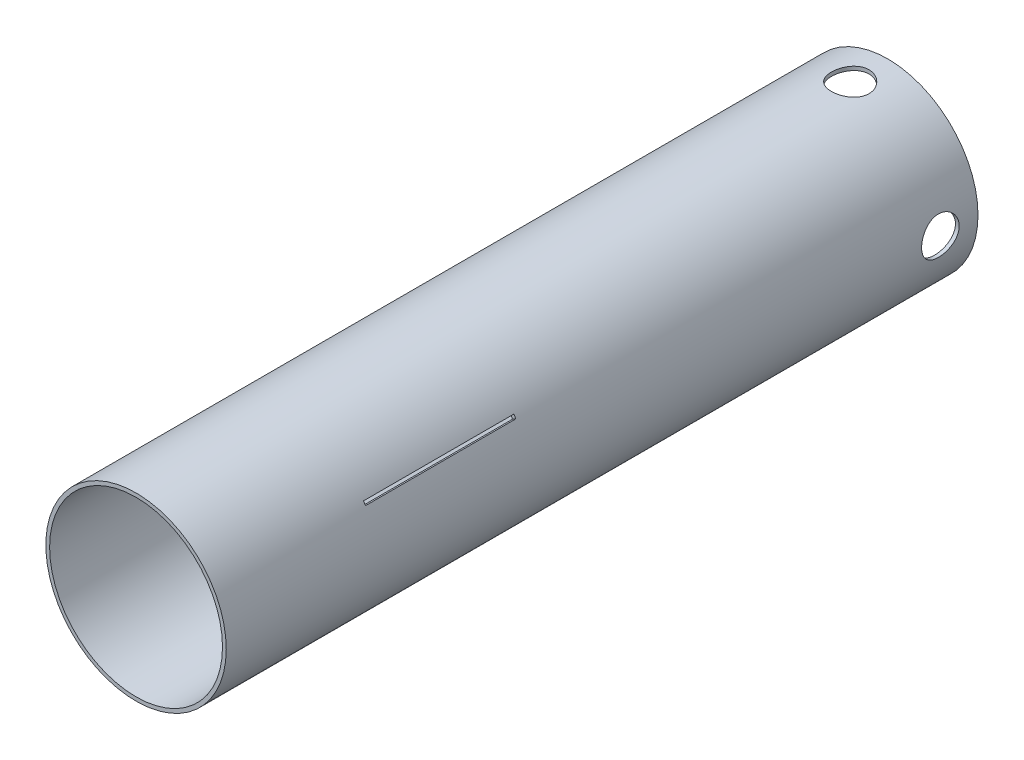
ISO-10303-21;
HEADER;
FILE_DESCRIPTION(('STEP AP214'),'2;1');
FILE_NAME('part.step','',(''),(''),'','','');
FILE_SCHEMA(('AUTOMOTIVE_DESIGN { 1 0 10303 214 1 1 1 1 }'));
ENDSEC;
DATA;
#1=APPLICATION_CONTEXT('core data for automotive mechanical design processes');
#2=APPLICATION_PROTOCOL_DEFINITION('international standard','automotive_design',2000,#1);
#3=PRODUCT_CONTEXT('',#1,'mechanical');
#4=PRODUCT('Part','Part','',(#3));
#5=PRODUCT_RELATED_PRODUCT_CATEGORY('part','',(#4));
#6=PRODUCT_DEFINITION_FORMATION('','',#4);
#7=PRODUCT_DEFINITION_CONTEXT('part definition',#1,'design');
#8=PRODUCT_DEFINITION('design','',#6,#7);
#9=PRODUCT_DEFINITION_SHAPE('','',#8);
#10=(LENGTH_UNIT() NAMED_UNIT(*) SI_UNIT(.MILLI.,.METRE.));
#11=(NAMED_UNIT(*) PLANE_ANGLE_UNIT() SI_UNIT($,.RADIAN.));
#12=(NAMED_UNIT(*) SI_UNIT($,.STERADIAN.) SOLID_ANGLE_UNIT());
#13=UNCERTAINTY_MEASURE_WITH_UNIT(LENGTH_MEASURE(1.E-05),#10,'distance_accuracy_value','');
#14=(GEOMETRIC_REPRESENTATION_CONTEXT(3) GLOBAL_UNCERTAINTY_ASSIGNED_CONTEXT((#13)) GLOBAL_UNIT_ASSIGNED_CONTEXT((#10,
#11,#12)) REPRESENTATION_CONTEXT('',''));
#15=CARTESIAN_POINT('',(0.,0.,0.));
#16=DIRECTION('',(0.,0.,1.));
#17=DIRECTION('',(1.,0.,0.));
#18=AXIS2_PLACEMENT_3D('',#15,#16,#17);
#19=CARTESIAN_POINT('',(0.,0.,2000.));
#20=DIRECTION('',(0.,0.,1.));
#21=DIRECTION('',(1.,0.,0.));
#22=AXIS2_PLACEMENT_3D('',#19,#20,#21);
#23=PLANE('',#22);
#24=CARTESIAN_POINT('',(0.,0.,2000.));
#25=DIRECTION('',(0.,0.,1.));
#26=DIRECTION('',(1.,0.,0.));
#27=AXIS2_PLACEMENT_3D('',#24,#25,#26);
#28=CIRCLE('',#27,240.);
#29=CARTESIAN_POINT('',(240.,0.,2000.));
#30=VERTEX_POINT('',#29);
#31=EDGE_CURVE('E169',#30,#30,#28,.T.);
#32=ORIENTED_EDGE('',*,*,#31,.T.);
#33=EDGE_LOOP('',(#32));
#34=FACE_BOUND('',#33,.T.);
#35=CARTESIAN_POINT('',(0.,0.,2000.));
#36=DIRECTION('',(0.,0.,1.));
#37=DIRECTION('',(1.,0.,0.));
#38=AXIS2_PLACEMENT_3D('',#35,#36,#37);
#39=CIRCLE('',#38,230.);
#40=CARTESIAN_POINT('',(230.,0.,2000.));
#41=VERTEX_POINT('',#40);
#42=EDGE_CURVE('E222',#41,#41,#39,.T.);
#43=ORIENTED_EDGE('',*,*,#42,.F.);
#44=EDGE_LOOP('',(#43));
#45=FACE_BOUND('',#44,.T.);
#46=ADVANCED_FACE('F33',(#34,#45),#23,.T.);
#47=CARTESIAN_POINT('',(0.,0.,0.));
#48=DIRECTION('',(0.,0.,1.));
#49=DIRECTION('',(1.,0.,0.));
#50=AXIS2_PLACEMENT_3D('',#47,#48,#49);
#51=PLANE('',#50);
#52=CARTESIAN_POINT('',(0.,0.,0.));
#53=DIRECTION('',(0.,0.,1.));
#54=DIRECTION('',(1.,0.,0.));
#55=AXIS2_PLACEMENT_3D('',#52,#53,#54);
#56=CIRCLE('',#55,240.);
#57=CARTESIAN_POINT('',(240.,0.,0.));
#58=VERTEX_POINT('',#57);
#59=EDGE_CURVE('E225',#58,#58,#56,.T.);
#60=ORIENTED_EDGE('',*,*,#59,.F.);
#61=EDGE_LOOP('',(#60));
#62=FACE_BOUND('',#61,.T.);
#63=CARTESIAN_POINT('',(0.,0.,0.));
#64=DIRECTION('',(0.,0.,1.));
#65=DIRECTION('',(1.,0.,0.));
#66=AXIS2_PLACEMENT_3D('',#63,#64,#65);
#67=CIRCLE('',#66,230.);
#68=CARTESIAN_POINT('',(230.,0.,0.));
#69=VERTEX_POINT('',#68);
#70=EDGE_CURVE('E221',#69,#69,#67,.T.);
#71=ORIENTED_EDGE('',*,*,#70,.T.);
#72=EDGE_LOOP('',(#71));
#73=FACE_BOUND('',#72,.T.);
#74=ADVANCED_FACE('F316',(#62,#73),#51,.F.);
#75=CARTESIAN_POINT('',(0.,0.,2000.));
#76=DIRECTION('',(0.,0.,-1.));
#77=DIRECTION('',(-1.,0.,0.));
#78=AXIS2_PLACEMENT_3D('',#75,#76,#77);
#79=CYLINDRICAL_SURFACE('',#78,240.);
#80=CARTESIAN_POINT('',(0.,0.,1200.));
#81=DIRECTION('',(0.,0.,-1.));
#82=DIRECTION('',(-1.,0.,0.));
#83=AXIS2_PLACEMENT_3D('',#80,#81,#82);
#84=CIRCLE('',#83,240.);
#85=CARTESIAN_POINT('',(-210.300986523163,115.643828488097,1200.));
#86=VERTEX_POINT('',#85);
#87=CARTESIAN_POINT('',(-205.300986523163,124.304082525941,1200.));
#88=VERTEX_POINT('',#87);
#89=EDGE_CURVE('E268',#86,#88,#84,.T.);
#90=ORIENTED_EDGE('',*,*,#89,.T.);
#91=DIRECTION('',(0.,0.,-1.));
#92=VECTOR('',#91,1.);
#93=CARTESIAN_POINT('',(-205.300986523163,124.304082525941,2000.));
#94=LINE('',#93,#92);
#95=CARTESIAN_POINT('',(-205.300986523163,124.304082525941,1600.));
#96=VERTEX_POINT('',#95);
#97=EDGE_CURVE('E258',#88,#96,#94,.F.);
#98=ORIENTED_EDGE('',*,*,#97,.T.);
#99=CARTESIAN_POINT('',(0.,0.,1600.));
#100=DIRECTION('',(0.,0.,1.));
#101=DIRECTION('',(1.,0.,0.));
#102=AXIS2_PLACEMENT_3D('',#99,#100,#101);
#103=CIRCLE('',#102,240.);
#104=CARTESIAN_POINT('',(-210.300986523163,115.643828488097,1600.));
#105=VERTEX_POINT('',#104);
#106=EDGE_CURVE('E274',#96,#105,#103,.T.);
#107=ORIENTED_EDGE('',*,*,#106,.T.);
#108=DIRECTION('',(0.,0.,-1.));
#109=VECTOR('',#108,1.);
#110=CARTESIAN_POINT('',(-210.300986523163,115.643828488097,2000.));
#111=LINE('',#110,#109);
#112=EDGE_CURVE('E270',#105,#86,#111,.T.);
#113=ORIENTED_EDGE('',*,*,#112,.T.);
#114=EDGE_LOOP('',(#90,#98,#107,#113));
#115=FACE_BOUND('',#114,.T.);
#116=CARTESIAN_POINT('',(205.300986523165,124.304082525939,1200.));
#117=VERTEX_POINT('',#116);
#118=CARTESIAN_POINT('',(210.300986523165,115.643828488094,1200.));
#119=VERTEX_POINT('',#118);
#120=EDGE_CURVE('E138',#117,#119,#84,.T.);
#121=ORIENTED_EDGE('',*,*,#120,.T.);
#122=DIRECTION('',(0.,0.,-1.));
#123=VECTOR('',#122,1.);
#124=CARTESIAN_POINT('',(210.300986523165,115.643828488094,2000.));
#125=LINE('',#124,#123);
#126=CARTESIAN_POINT('',(210.300986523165,115.643828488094,1600.));
#127=VERTEX_POINT('',#126);
#128=EDGE_CURVE('E277',#119,#127,#125,.F.);
#129=ORIENTED_EDGE('',*,*,#128,.T.);
#130=CARTESIAN_POINT('',(205.300986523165,124.304082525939,1600.));
#131=VERTEX_POINT('',#130);
#132=EDGE_CURVE('E273',#127,#131,#103,.T.);
#133=ORIENTED_EDGE('',*,*,#132,.T.);
#134=DIRECTION('',(0.,0.,-1.));
#135=VECTOR('',#134,1.);
#136=CARTESIAN_POINT('',(205.300986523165,124.304082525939,2000.));
#137=LINE('',#136,#135);
#138=EDGE_CURVE('E280',#131,#117,#137,.T.);
#139=ORIENTED_EDGE('',*,*,#138,.T.);
#140=EDGE_LOOP('',(#121,#129,#133,#139));
#141=FACE_BOUND('',#140,.T.);
#142=DIRECTION('',(0.,0.,-1.));
#143=VECTOR('',#142,1.);
#144=CARTESIAN_POINT('',(-4.99999999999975,-239.947911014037,2000.));
#145=LINE('',#144,#143);
#146=CARTESIAN_POINT('',(-4.99999999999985,-239.947911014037,1200.));
#147=VERTEX_POINT('',#146);
#148=CARTESIAN_POINT('',(-4.9999999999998,-239.947911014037,1600.));
#149=VERTEX_POINT('',#148);
#150=EDGE_CURVE('E239',#147,#149,#145,.F.);
#151=ORIENTED_EDGE('',*,*,#150,.T.);
#152=CARTESIAN_POINT('',(0.,0.,1600.));
#153=DIRECTION('',(0.,0.,1.));
#154=DIRECTION('',(1.,0.,0.));
#155=AXIS2_PLACEMENT_3D('',#152,#153,#154);
#156=CIRCLE('',#155,240.);
#157=CARTESIAN_POINT('',(5.00000000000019,-239.947911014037,1600.));
#158=VERTEX_POINT('',#157);
#159=EDGE_CURVE('E252',#149,#158,#156,.T.);
#160=ORIENTED_EDGE('',*,*,#159,.T.);
#161=DIRECTION('',(0.,0.,-1.));
#162=VECTOR('',#161,1.);
#163=CARTESIAN_POINT('',(5.00000000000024,-239.947911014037,2000.));
#164=LINE('',#163,#162);
#165=CARTESIAN_POINT('',(5.00000000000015,-239.947911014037,1200.));
#166=VERTEX_POINT('',#165);
#167=EDGE_CURVE('E247',#158,#166,#164,.T.);
#168=ORIENTED_EDGE('',*,*,#167,.T.);
#169=CARTESIAN_POINT('',(0.,0.,1200.));
#170=DIRECTION('',(0.,0.,-1.));
#171=DIRECTION('',(-1.,0.,0.));
#172=AXIS2_PLACEMENT_3D('',#169,#170,#171);
#173=CIRCLE('',#172,240.);
#174=EDGE_CURVE('E244',#166,#147,#173,.T.);
#175=ORIENTED_EDGE('',*,*,#174,.T.);
#176=EDGE_LOOP('',(#151,#160,#168,#175));
#177=FACE_BOUND('',#176,.T.);
#178=CARTESIAN_POINT('',(-240.,0.,150.));
#179=CARTESIAN_POINT('',(-239.999996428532,-1.38833927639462,149.999992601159));
#180=CARTESIAN_POINT('',(-239.987922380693,-2.77684302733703,149.942126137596));
#181=CARTESIAN_POINT('',(-239.939951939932,-5.54394121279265,149.71109533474));
#182=CARTESIAN_POINT('',(-239.90405172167,-6.92253402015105,149.537912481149));
#183=CARTESIAN_POINT('',(-239.80939948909,-9.66073254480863,149.077478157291));
#184=CARTESIAN_POINT('',(-239.750631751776,-11.0203245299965,148.790148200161));
#185=CARTESIAN_POINT('',(-239.611882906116,-13.7098097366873,148.103713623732));
#186=CARTESIAN_POINT('',(-239.531902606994,-15.0397040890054,147.704613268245));
#187=CARTESIAN_POINT('',(-239.353029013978,-17.6592602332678,146.798178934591));
#188=CARTESIAN_POINT('',(-239.254154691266,-18.948960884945,146.290953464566));
#189=CARTESIAN_POINT('',(-239.040149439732,-21.4807143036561,145.171833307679));
#190=CARTESIAN_POINT('',(-238.92501837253,-22.7227666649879,144.559937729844));
#191=CARTESIAN_POINT('',(-238.681641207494,-25.1508035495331,143.235969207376));
#192=CARTESIAN_POINT('',(-238.553396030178,-26.3367919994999,142.523903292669));
#193=CARTESIAN_POINT('',(-238.287253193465,-28.6449799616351,141.004563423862));
#194=CARTESIAN_POINT('',(-238.149355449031,-29.7671789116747,140.19728863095));
#195=CARTESIAN_POINT('',(-237.865777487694,-31.9547250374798,138.481850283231));
#196=CARTESIAN_POINT('',(-237.72001890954,-33.019133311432,137.572502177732));
#197=CARTESIAN_POINT('',(-237.426446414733,-35.0678440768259,135.667947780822));
#198=CARTESIAN_POINT('',(-237.278632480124,-36.052145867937,134.672740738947));
#199=CARTESIAN_POINT('',(-236.985045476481,-37.9340945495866,132.603081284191));
#200=CARTESIAN_POINT('',(-236.83927257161,-38.8317345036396,131.528622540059));
#201=CARTESIAN_POINT('',(-236.553861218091,-40.5341327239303,129.307708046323));
#202=CARTESIAN_POINT('',(-236.414222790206,-41.3388906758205,128.161252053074));
#203=CARTESIAN_POINT('',(-236.143690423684,-42.8574199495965,125.792260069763));
#204=CARTESIAN_POINT('',(-236.01289749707,-43.5702046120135,124.569079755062));
#205=CARTESIAN_POINT('',(-235.765427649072,-44.8900233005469,122.065543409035));
#206=CARTESIAN_POINT('',(-235.648750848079,-45.4970564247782,120.785186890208));
#207=CARTESIAN_POINT('',(-235.432989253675,-46.6006859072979,118.176407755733));
#208=CARTESIAN_POINT('',(-235.333902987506,-47.0972915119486,116.847989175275));
#209=CARTESIAN_POINT('',(-235.156300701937,-47.9761970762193,114.152523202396));
#210=CARTESIAN_POINT('',(-235.077784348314,-48.3584988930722,112.785476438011));
#211=CARTESIAN_POINT('',(-234.94467160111,-49.0010970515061,110.042346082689));
#212=CARTESIAN_POINT('',(-234.889751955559,-49.263045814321,108.66666518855));
#213=CARTESIAN_POINT('',(-234.8038857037,-49.6707034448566,105.897443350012));
#214=CARTESIAN_POINT('',(-234.772938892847,-49.8164133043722,104.503902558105));
#215=CARTESIAN_POINT('',(-234.73595779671,-49.9903796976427,101.709314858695));
#216=CARTESIAN_POINT('',(-234.729921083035,-50.0186476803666,100.308268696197));
#217=CARTESIAN_POINT('',(-234.742937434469,-49.9575250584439,97.5088697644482));
#218=CARTESIAN_POINT('',(-234.76199026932,-49.8681355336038,96.1105169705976));
#219=CARTESIAN_POINT('',(-234.824089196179,-49.5748832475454,93.349722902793));
#220=CARTESIAN_POINT('',(-234.866735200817,-49.3729289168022,91.9870693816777));
#221=CARTESIAN_POINT('',(-234.974488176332,-48.8575389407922,89.2839374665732));
#222=CARTESIAN_POINT('',(-235.039594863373,-48.5441047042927,87.9434587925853));
#223=CARTESIAN_POINT('',(-235.19038855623,-47.8081796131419,85.293930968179));
#224=CARTESIAN_POINT('',(-235.276076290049,-47.3856849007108,83.9848829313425));
#225=CARTESIAN_POINT('',(-235.4655829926,-46.4348363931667,81.4071731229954));
#226=CARTESIAN_POINT('',(-235.569402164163,-45.9064814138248,80.1385118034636));
#227=CARTESIAN_POINT('',(-235.793058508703,-44.7435637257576,77.6410024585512));
#228=CARTESIAN_POINT('',(-235.913006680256,-44.1082565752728,76.4125110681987));
#229=CARTESIAN_POINT('',(-236.164955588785,-42.7387211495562,74.0132772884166));
#230=CARTESIAN_POINT('',(-236.296956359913,-42.0044925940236,72.8425350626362));
#231=CARTESIAN_POINT('',(-236.569361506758,-40.4421290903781,70.5663474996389));
#232=CARTESIAN_POINT('',(-236.709766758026,-39.6139843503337,69.4609089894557));
#233=CARTESIAN_POINT('',(-236.995119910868,-37.869435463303,67.3226401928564));
#234=CARTESIAN_POINT('',(-237.140067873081,-36.9530301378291,66.2898108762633));
#235=CARTESIAN_POINT('',(-237.43341594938,-35.0192478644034,64.2840274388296));
#236=CARTESIAN_POINT('',(-237.581828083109,-34.0002451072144,63.3126418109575));
#237=CARTESIAN_POINT('',(-237.875118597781,-31.8836820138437,61.4589849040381));
#238=CARTESIAN_POINT('',(-238.019996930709,-30.7861206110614,60.5767148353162));
#239=CARTESIAN_POINT('',(-238.30216643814,-28.5198376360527,58.9074276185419));
#240=CARTESIAN_POINT('',(-238.439457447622,-27.3511145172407,58.1204125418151));
#241=CARTESIAN_POINT('',(-238.702600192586,-24.9504803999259,56.6472979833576));
#242=CARTESIAN_POINT('',(-238.828451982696,-23.7185697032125,55.9611980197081));
#243=CARTESIAN_POINT('',(-239.06539043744,-21.197745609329,54.693826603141));
#244=CARTESIAN_POINT('',(-239.176449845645,-19.9087326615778,54.1127479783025));
#245=CARTESIAN_POINT('',(-239.380376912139,-17.2848630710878,53.0614127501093));
#246=CARTESIAN_POINT('',(-239.473244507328,-15.9500062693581,52.5911565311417));
#247=CARTESIAN_POINT('',(-239.638119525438,-13.2441858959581,51.7652386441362));
#248=CARTESIAN_POINT('',(-239.710129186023,-11.8732262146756,51.4095646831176));
#249=CARTESIAN_POINT('',(-239.831223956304,-9.10511086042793,50.8156462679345));
#250=CARTESIAN_POINT('',(-239.880309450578,-7.70795562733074,50.5773998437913));
#251=CARTESIAN_POINT('',(-239.953466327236,-4.92328607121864,50.2235457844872));
#252=CARTESIAN_POINT('',(-239.977974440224,-3.53605506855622,50.105796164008));
#253=CARTESIAN_POINT('',(-240.002832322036,-0.756396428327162,49.986372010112));
#254=CARTESIAN_POINT('',(-240.00318238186,0.636031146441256,49.9846960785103));
#255=CARTESIAN_POINT('',(-239.979715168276,3.41588931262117,50.097427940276));
#256=CARTESIAN_POINT('',(-239.955899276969,4.80332018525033,50.2118290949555));
#257=CARTESIAN_POINT('',(-239.884770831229,7.56321975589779,50.5557735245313));
#258=CARTESIAN_POINT('',(-239.837458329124,8.93568848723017,50.7853165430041));
#259=CARTESIAN_POINT('',(-239.721237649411,11.6423893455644,51.3548709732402));
#260=CARTESIAN_POINT('',(-239.652547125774,12.9768651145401,51.6937702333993));
#261=CARTESIAN_POINT('',(-239.495303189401,15.612250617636,52.4800200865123));
#262=CARTESIAN_POINT('',(-239.406749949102,16.9131606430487,52.9273697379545));
#263=CARTESIAN_POINT('',(-239.212171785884,19.4726574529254,53.9271942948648));
#264=CARTESIAN_POINT('',(-239.106145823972,20.7312417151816,54.4796754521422));
#265=CARTESIAN_POINT('',(-238.87947551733,23.1976302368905,55.6857309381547));
#266=CARTESIAN_POINT('',(-238.758830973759,24.40543380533,56.3393066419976));
#267=CARTESIAN_POINT('',(-238.50448568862,26.7778331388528,57.7521751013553));
#268=CARTESIAN_POINT('',(-238.370634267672,27.9416529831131,58.5127436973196));
#269=CARTESIAN_POINT('',(-238.094887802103,30.2013283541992,60.1275997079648));
#270=CARTESIAN_POINT('',(-237.952992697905,31.2971833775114,60.9818878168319));
#271=CARTESIAN_POINT('',(-237.665011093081,33.4138239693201,62.7784536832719));
#272=CARTESIAN_POINT('',(-237.518924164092,34.434601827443,63.720740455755));
#273=CARTESIAN_POINT('',(-237.226560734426,36.3942381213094,65.6869410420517));
#274=CARTESIAN_POINT('',(-237.080284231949,37.3330957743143,66.7108556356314));
#275=CARTESIAN_POINT('',(-236.78915400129,39.1375243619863,68.8512301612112));
#276=CARTESIAN_POINT('',(-236.644364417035,40.0016164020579,69.9689462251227));
#277=CARTESIAN_POINT('',(-236.362883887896,41.6325863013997,72.2741758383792));
#278=CARTESIAN_POINT('',(-236.226193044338,42.3994629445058,73.4616902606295));
#279=CARTESIAN_POINT('',(-235.964875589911,43.8304315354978,75.8983522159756));
#280=CARTESIAN_POINT('',(-235.840248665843,44.4945261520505,77.1474981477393));
#281=CARTESIAN_POINT('',(-235.606720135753,45.7149833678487,79.6987720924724));
#282=CARTESIAN_POINT('',(-235.497818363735,46.2713471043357,81.0008995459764));
#283=CARTESIAN_POINT('',(-235.299532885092,47.2693074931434,83.6416967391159));
#284=CARTESIAN_POINT('',(-235.210045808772,47.7115144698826,84.9801280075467));
#285=CARTESIAN_POINT('',(-235.052521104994,48.4816150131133,87.6907329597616));
#286=CARTESIAN_POINT('',(-234.984483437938,48.8095087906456,89.0629065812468));
#287=CARTESIAN_POINT('',(-234.871930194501,49.3482752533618,91.8308266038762));
#288=CARTESIAN_POINT('',(-234.82741179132,49.5591620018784,93.2265701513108));
#289=CARTESIAN_POINT('',(-234.763250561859,49.8622131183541,96.0314482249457));
#290=CARTESIAN_POINT('',(-234.74360734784,49.9543793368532,97.4405825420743));
#291=CARTESIAN_POINT('',(-234.729935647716,50.0185791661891,100.233833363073));
#292=CARTESIAN_POINT('',(-234.735408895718,49.9929496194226,101.617894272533));
#293=CARTESIAN_POINT('',(-234.770672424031,49.8270864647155,104.378804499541));
#294=CARTESIAN_POINT('',(-234.800462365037,49.6868544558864,105.755653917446));
#295=CARTESIAN_POINT('',(-234.883477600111,49.2929239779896,108.49227439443));
#296=CARTESIAN_POINT('',(-234.936702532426,49.0392272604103,109.852045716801));
#297=CARTESIAN_POINT('',(-235.065025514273,48.4203830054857,112.544926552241));
#298=CARTESIAN_POINT('',(-235.140123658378,48.0552349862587,113.878035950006));
#299=CARTESIAN_POINT('',(-235.309767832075,47.2175292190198,116.50453168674));
#300=CARTESIAN_POINT('',(-235.404257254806,46.7452836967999,117.798021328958));
#301=CARTESIAN_POINT('',(-235.610124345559,45.6963320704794,120.340511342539));
#302=CARTESIAN_POINT('',(-235.721501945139,45.1196263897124,121.589511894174));
#303=CARTESIAN_POINT('',(-235.958029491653,43.8658759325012,124.034827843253));
#304=CARTESIAN_POINT('',(-236.083180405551,43.1888241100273,125.231139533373));
#305=CARTESIAN_POINT('',(-236.343789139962,41.7391362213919,127.563193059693));
#306=CARTESIAN_POINT('',(-236.479247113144,40.9664987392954,128.698933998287));
#307=CARTESIAN_POINT('',(-236.759330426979,39.31580909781,130.922804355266));
#308=CARTESIAN_POINT('',(-236.904078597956,38.4360786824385,132.00967296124));
#309=CARTESIAN_POINT('',(-237.196384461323,36.5889233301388,134.105749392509));
#310=CARTESIAN_POINT('',(-237.343942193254,35.6214971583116,135.114956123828));
#311=CARTESIAN_POINT('',(-237.637805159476,33.6052294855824,137.04916458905));
#312=CARTESIAN_POINT('',(-237.784110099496,32.5563694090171,137.974147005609));
#313=CARTESIAN_POINT('',(-238.071387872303,30.3844365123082,139.73334909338));
#314=CARTESIAN_POINT('',(-238.212360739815,29.2613641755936,140.567569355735));
#315=CARTESIAN_POINT('',(-238.486657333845,26.935133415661,142.14853498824));
#316=CARTESIAN_POINT('',(-238.619873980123,25.7312001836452,142.894159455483));
#317=CARTESIAN_POINT('',(-238.873099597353,23.2632911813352,144.281180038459));
#318=CARTESIAN_POINT('',(-238.993107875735,21.9993122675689,144.922570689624));
#319=CARTESIAN_POINT('',(-239.216401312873,19.4212782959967,146.095749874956));
#320=CARTESIAN_POINT('',(-239.319699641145,18.1072636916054,146.627624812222));
#321=CARTESIAN_POINT('',(-239.506714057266,15.437714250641,147.578184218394));
#322=CARTESIAN_POINT('',(-239.590433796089,14.0821872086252,147.996889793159));
#323=CARTESIAN_POINT('',(-239.718053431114,11.6760487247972,148.629368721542));
#324=CARTESIAN_POINT('',(-239.76668356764,10.6321993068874,148.868217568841));
#325=CARTESIAN_POINT('',(-239.850652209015,8.53055682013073,149.278554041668));
#326=CARTESIAN_POINT('',(-239.885988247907,7.4727612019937,149.450029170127));
#327=CARTESIAN_POINT('',(-239.942760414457,5.34800153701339,149.724705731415));
#328=CARTESIAN_POINT('',(-239.964196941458,4.28103775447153,149.827909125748));
#329=CARTESIAN_POINT('',(-239.992816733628,2.1427480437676,149.965552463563));
#330=CARTESIAN_POINT('',(-240.000002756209,1.07142299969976,150.000005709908));
#331=CARTESIAN_POINT('',(-240.,0.,150.));
#332=B_SPLINE_CURVE_WITH_KNOTS('',3,(#178,#179,#180,#181,#182,#183,#184,#185,#186,#187,#188,
#189,#190,#191,#192,#193,#194,#195,#196,#197,#198,#199,#200,#201,#202,#203,#204,#205,#206,#207,
#208,#209,#210,#211,#212,#213,#214,#215,#216,#217,#218,#219,#220,#221,#222,#223,#224,#225,#226,
#227,#228,#229,#230,#231,#232,#233,#234,#235,#236,#237,#238,#239,#240,#241,#242,#243,#244,#245,
#246,#247,#248,#249,#250,#251,#252,#253,#254,#255,#256,#257,#258,#259,#260,#261,#262,#263,#264,
#265,#266,#267,#268,#269,#270,#271,#272,#273,#274,#275,#276,#277,#278,#279,#280,#281,#282,#283,
#284,#285,#286,#287,#288,#289,#290,#291,#292,#293,#294,#295,#296,#297,#298,#299,#300,#301,#302,
#303,#304,#305,#306,#307,#308,#309,#310,#311,#312,#313,#314,#315,#316,#317,#318,#319,#320,#321,
#322,#323,#324,#325,#326,#327,#328,#329,#330,#331),.UNSPECIFIED.,.T.,.F.,(4,2,2,2,2,2,2,2,2,2,2,
2,2,2,2,2,2,2,2,2,2,2,2,2,2,2,2,2,2,2,2,2,2,2,2,2,2,2,2,2,2,2,2,2,2,2,2,2,2,2,2,2,2,2,2,2,2,2,2,
2,2,2,2,2,2,2,2,2,2,2,2,2,2,2,2,2,4),(0.,4.16404842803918,8.32876556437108,12.4963513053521,
16.6637780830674,20.8270421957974,24.9903417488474,29.1533492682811,33.3163934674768,
37.5340489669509,41.751741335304,45.9697710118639,50.1878149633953,54.4478942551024,
58.7080098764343,62.9677686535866,67.2274582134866,71.4267739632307,75.6260538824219,
79.8249244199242,84.0237564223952,88.1534762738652,92.2831439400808,96.4129577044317,
100.542817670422,104.702711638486,108.862617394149,113.02295727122,117.183352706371,
121.425215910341,125.66713671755,129.909149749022,134.151142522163,138.40084653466,
142.650565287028,146.899827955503,151.149019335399,155.321290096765,159.493510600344,
163.665492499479,167.837465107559,171.968279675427,176.099058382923,180.230082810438,
184.361163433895,188.546506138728,192.731879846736,196.917682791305,201.103525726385,
205.358998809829,209.614525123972,213.869940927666,218.125311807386,222.357437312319,
226.589555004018,230.821163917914,235.052706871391,239.200670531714,243.348576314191,
247.496418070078,251.644277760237,255.78019702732,259.916099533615,264.052292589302,
268.188546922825,272.400919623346,276.613351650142,280.826747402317,285.040115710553,
289.3021200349,293.564347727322,297.823199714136,302.081256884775,305.294896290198,
308.509131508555,311.723274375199,314.936795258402),.UNSPECIFIED.);
#333=CARTESIAN_POINT('',(-240.,0.,150.));
#334=VERTEX_POINT('',#333);
#335=EDGE_CURVE('E206',#334,#334,#332,.T.);
#336=ORIENTED_EDGE('',*,*,#335,.T.);
#337=EDGE_LOOP('',(#336));
#338=FACE_BOUND('',#337,.T.);
#339=CARTESIAN_POINT('',(0.,240.,50.));
#340=CARTESIAN_POINT('',(1.38833927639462,239.999996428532,50.0000073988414));
#341=CARTESIAN_POINT('',(2.77684302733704,239.987922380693,50.0578738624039));
#342=CARTESIAN_POINT('',(5.54394121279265,239.939951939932,50.2889046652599));
#343=CARTESIAN_POINT('',(6.92253402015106,239.90405172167,50.462087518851));
#344=CARTESIAN_POINT('',(9.66073254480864,239.80939948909,50.9225218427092));
#345=CARTESIAN_POINT('',(11.0203245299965,239.750631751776,51.2098517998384));
#346=CARTESIAN_POINT('',(13.7098097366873,239.611882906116,51.8962863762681));
#347=CARTESIAN_POINT('',(15.0397040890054,239.531902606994,52.2953867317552));
#348=CARTESIAN_POINT('',(17.6592602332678,239.353029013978,53.2018210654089));
#349=CARTESIAN_POINT('',(18.948960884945,239.254154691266,53.7090465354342));
#350=CARTESIAN_POINT('',(21.4807143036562,239.040149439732,54.8281666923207));
#351=CARTESIAN_POINT('',(22.722766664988,238.92501837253,55.4400622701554));
#352=CARTESIAN_POINT('',(25.1508035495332,238.681641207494,56.7640307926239));
#353=CARTESIAN_POINT('',(26.3367919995,238.553396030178,57.4760967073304));
#354=CARTESIAN_POINT('',(28.6449799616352,238.287253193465,58.9954365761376));
#355=CARTESIAN_POINT('',(29.7671789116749,238.149355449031,59.8027113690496));
#356=CARTESIAN_POINT('',(31.95472503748,237.865777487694,61.518149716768));
#357=CARTESIAN_POINT('',(33.0191333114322,237.72001890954,62.4274978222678));
#358=CARTESIAN_POINT('',(35.0678440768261,237.426446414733,64.3320522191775));
#359=CARTESIAN_POINT('',(36.0521458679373,237.278632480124,65.3272592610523));
#360=CARTESIAN_POINT('',(37.9340945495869,236.985045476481,67.3969187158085));
#361=CARTESIAN_POINT('',(38.8317345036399,236.83927257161,68.4713774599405));
#362=CARTESIAN_POINT('',(40.5341327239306,236.553861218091,70.6922919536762));
#363=CARTESIAN_POINT('',(41.3388906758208,236.414222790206,71.8387479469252));
#364=CARTESIAN_POINT('',(42.8574199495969,236.143690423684,74.2077399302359));
#365=CARTESIAN_POINT('',(43.5702046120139,236.012897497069,75.4309202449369));
#366=CARTESIAN_POINT('',(44.8900233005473,235.765427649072,77.9344565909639));
#367=CARTESIAN_POINT('',(45.4970564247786,235.648750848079,79.214813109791));
#368=CARTESIAN_POINT('',(46.6006859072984,235.432989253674,81.8235922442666));
#369=CARTESIAN_POINT('',(47.0972915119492,235.333902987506,83.1520108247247));
#370=CARTESIAN_POINT('',(47.9761970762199,235.156300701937,85.8474767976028));
#371=CARTESIAN_POINT('',(48.3584988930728,235.077784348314,87.2145235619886));
#372=CARTESIAN_POINT('',(49.0010970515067,234.94467160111,89.9576539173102));
#373=CARTESIAN_POINT('',(49.2630458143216,234.889751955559,91.3333348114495));
#374=CARTESIAN_POINT('',(49.6707034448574,234.8038857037,94.1025566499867));
#375=CARTESIAN_POINT('',(49.8164133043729,234.772938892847,95.4960974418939));
#376=CARTESIAN_POINT('',(49.9903796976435,234.73595779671,98.290685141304));
#377=CARTESIAN_POINT('',(50.0186476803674,234.729921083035,99.6917313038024));
#378=CARTESIAN_POINT('',(49.9575250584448,234.742937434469,102.491130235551));
#379=CARTESIAN_POINT('',(49.8681355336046,234.761990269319,103.889483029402));
#380=CARTESIAN_POINT('',(49.5748832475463,234.824089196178,106.650277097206));
#381=CARTESIAN_POINT('',(49.3729289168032,234.866735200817,108.012930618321));
#382=CARTESIAN_POINT('',(48.8575389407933,234.974488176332,110.716062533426));
#383=CARTESIAN_POINT('',(48.5441047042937,235.039594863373,112.056541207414));
#384=CARTESIAN_POINT('',(47.8081796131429,235.19038855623,114.70606903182));
#385=CARTESIAN_POINT('',(47.3856849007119,235.276076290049,116.015117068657));
#386=CARTESIAN_POINT('',(46.4348363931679,235.4655829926,118.592826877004));
#387=CARTESIAN_POINT('',(45.9064814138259,235.569402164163,119.861488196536));
#388=CARTESIAN_POINT('',(44.7435637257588,235.793058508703,122.358997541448));
#389=CARTESIAN_POINT('',(44.1082565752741,235.913006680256,123.587488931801));
#390=CARTESIAN_POINT('',(42.7387211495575,236.164955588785,125.986722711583));
#391=CARTESIAN_POINT('',(42.0044925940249,236.296956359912,127.157464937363));
#392=CARTESIAN_POINT('',(40.4421290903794,236.569361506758,129.43365250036));
#393=CARTESIAN_POINT('',(39.6139843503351,236.709766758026,130.539091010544));
#394=CARTESIAN_POINT('',(37.8694354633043,236.995119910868,132.677359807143));
#395=CARTESIAN_POINT('',(36.9530301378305,237.140067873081,133.710189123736));
#396=CARTESIAN_POINT('',(35.0192478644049,237.43341594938,135.71597256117));
#397=CARTESIAN_POINT('',(34.0002451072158,237.581828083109,136.687358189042));
#398=CARTESIAN_POINT('',(31.8836820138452,237.875118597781,138.541015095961));
#399=CARTESIAN_POINT('',(30.7861206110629,238.019996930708,139.423285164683));
#400=CARTESIAN_POINT('',(28.5198376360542,238.30216643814,141.092572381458));
#401=CARTESIAN_POINT('',(27.3511145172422,238.439457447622,141.879587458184));
#402=CARTESIAN_POINT('',(24.9504803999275,238.702600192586,143.352702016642));
#403=CARTESIAN_POINT('',(23.7185697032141,238.828451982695,144.038801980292));
#404=CARTESIAN_POINT('',(21.1977456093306,239.06539043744,145.306173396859));
#405=CARTESIAN_POINT('',(19.9087326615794,239.176449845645,145.887252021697));
#406=CARTESIAN_POINT('',(17.2848630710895,239.380376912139,146.93858724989));
#407=CARTESIAN_POINT('',(15.9500062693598,239.473244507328,147.408843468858));
#408=CARTESIAN_POINT('',(13.2441858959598,239.638119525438,148.234761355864));
#409=CARTESIAN_POINT('',(11.8732262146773,239.710129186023,148.590435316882));
#410=CARTESIAN_POINT('',(9.1051108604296,239.831223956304,149.184353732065));
#411=CARTESIAN_POINT('',(7.70795562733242,239.880309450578,149.422600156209));
#412=CARTESIAN_POINT('',(4.92328607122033,239.953466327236,149.776454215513));
#413=CARTESIAN_POINT('',(3.53605506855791,239.977974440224,149.894203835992));
#414=CARTESIAN_POINT('',(0.756396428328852,240.002832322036,150.013627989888));
#415=CARTESIAN_POINT('',(-0.636031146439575,240.00318238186,150.01530392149));
#416=CARTESIAN_POINT('',(-3.4158893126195,239.979715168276,149.902572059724));
#417=CARTESIAN_POINT('',(-4.80332018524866,239.955899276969,149.788170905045));
#418=CARTESIAN_POINT('',(-7.56321975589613,239.884770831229,149.444226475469));
#419=CARTESIAN_POINT('',(-8.93568848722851,239.837458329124,149.214683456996));
#420=CARTESIAN_POINT('',(-11.6423893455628,239.721237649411,148.64512902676));
#421=CARTESIAN_POINT('',(-12.9768651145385,239.652547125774,148.306229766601));
#422=CARTESIAN_POINT('',(-15.6122506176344,239.495303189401,147.519979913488));
#423=CARTESIAN_POINT('',(-16.913160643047,239.406749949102,147.072630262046));
#424=CARTESIAN_POINT('',(-19.4726574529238,239.212171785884,146.072805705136));
#425=CARTESIAN_POINT('',(-20.73124171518,239.106145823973,145.520324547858));
#426=CARTESIAN_POINT('',(-23.1976302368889,238.87947551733,144.314269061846));
#427=CARTESIAN_POINT('',(-24.4054338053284,238.758830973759,143.660693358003));
#428=CARTESIAN_POINT('',(-26.7778331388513,238.50448568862,142.247824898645));
#429=CARTESIAN_POINT('',(-27.9416529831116,238.370634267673,141.487256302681));
#430=CARTESIAN_POINT('',(-30.2013283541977,238.094887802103,139.872400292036));
#431=CARTESIAN_POINT('',(-31.2971833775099,237.952992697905,139.018112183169));
#432=CARTESIAN_POINT('',(-33.4138239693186,237.665011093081,137.221546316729));
#433=CARTESIAN_POINT('',(-34.4346018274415,237.518924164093,136.279259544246));
#434=CARTESIAN_POINT('',(-36.394238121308,237.226560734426,134.313058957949));
#435=CARTESIAN_POINT('',(-37.3330957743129,237.08028423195,133.289144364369));
#436=CARTESIAN_POINT('',(-39.1375243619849,236.78915400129,131.148769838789));
#437=CARTESIAN_POINT('',(-40.0016164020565,236.644364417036,130.031053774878));
#438=CARTESIAN_POINT('',(-41.6325863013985,236.362883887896,127.725824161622));
#439=CARTESIAN_POINT('',(-42.3994629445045,236.226193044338,126.538309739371));
#440=CARTESIAN_POINT('',(-43.8304315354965,235.964875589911,124.101647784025));
#441=CARTESIAN_POINT('',(-44.4945261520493,235.840248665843,122.852501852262));
#442=CARTESIAN_POINT('',(-45.7149833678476,235.606720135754,120.301227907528));
#443=CARTESIAN_POINT('',(-46.2713471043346,235.497818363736,118.999100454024));
#444=CARTESIAN_POINT('',(-47.2693074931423,235.299532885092,116.358303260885));
#445=CARTESIAN_POINT('',(-47.7115144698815,235.210045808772,115.019871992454));
#446=CARTESIAN_POINT('',(-48.4816150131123,235.052521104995,112.309267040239));
#447=CARTESIAN_POINT('',(-48.8095087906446,234.984483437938,110.937093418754));
#448=CARTESIAN_POINT('',(-49.3482752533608,234.871930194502,108.169173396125));
#449=CARTESIAN_POINT('',(-49.5591620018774,234.82741179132,106.77342984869));
#450=CARTESIAN_POINT('',(-49.8622131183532,234.763250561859,103.968551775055));
#451=CARTESIAN_POINT('',(-49.9543793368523,234.74360734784,102.559417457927));
#452=CARTESIAN_POINT('',(-50.0185791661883,234.729935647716,99.7661666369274));
#453=CARTESIAN_POINT('',(-49.9929496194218,234.735408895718,98.382105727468));
#454=CARTESIAN_POINT('',(-49.8270864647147,234.770672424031,95.6211955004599));
#455=CARTESIAN_POINT('',(-49.6868544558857,234.800462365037,94.244346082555));
#456=CARTESIAN_POINT('',(-49.2929239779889,234.883477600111,91.5077256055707));
#457=CARTESIAN_POINT('',(-49.0392272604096,234.936702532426,90.1479542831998));
#458=CARTESIAN_POINT('',(-48.4203830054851,235.065025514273,87.4550734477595));
#459=CARTESIAN_POINT('',(-48.0552349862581,235.140123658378,86.1219640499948));
#460=CARTESIAN_POINT('',(-47.2175292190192,235.309767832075,83.4954683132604));
#461=CARTESIAN_POINT('',(-46.7452836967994,235.404257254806,82.2019786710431));
#462=CARTESIAN_POINT('',(-45.696332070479,235.610124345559,79.659488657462));
#463=CARTESIAN_POINT('',(-45.1196263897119,235.72150194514,78.410488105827));
#464=CARTESIAN_POINT('',(-43.8658759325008,235.958029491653,75.9651721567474));
#465=CARTESIAN_POINT('',(-43.1888241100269,236.083180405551,74.7688604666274));
#466=CARTESIAN_POINT('',(-41.7391362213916,236.343789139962,72.4368069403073));
#467=CARTESIAN_POINT('',(-40.9664987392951,236.479247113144,71.3010660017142));
#468=CARTESIAN_POINT('',(-39.3158090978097,236.759330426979,69.0771956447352));
#469=CARTESIAN_POINT('',(-38.4360786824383,236.904078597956,67.9903270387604));
#470=CARTESIAN_POINT('',(-36.5889233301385,237.196384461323,65.8942506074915));
#471=CARTESIAN_POINT('',(-35.6214971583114,237.343942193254,64.885043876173));
#472=CARTESIAN_POINT('',(-33.6052294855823,237.637805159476,62.9508354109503));
#473=CARTESIAN_POINT('',(-32.556369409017,237.784110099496,62.0258529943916));
#474=CARTESIAN_POINT('',(-30.3844365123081,238.071387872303,60.266650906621));
#475=CARTESIAN_POINT('',(-29.2613641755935,238.212360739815,59.4324306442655));
#476=CARTESIAN_POINT('',(-26.9351334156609,238.486657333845,57.8514650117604));
#477=CARTESIAN_POINT('',(-25.7312001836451,238.619873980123,57.105840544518));
#478=CARTESIAN_POINT('',(-23.2632911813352,238.873099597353,55.7188199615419));
#479=CARTESIAN_POINT('',(-21.9993122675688,238.993107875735,55.0774293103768));
#480=CARTESIAN_POINT('',(-19.4212782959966,239.216401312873,53.9042501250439));
#481=CARTESIAN_POINT('',(-18.1072636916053,239.319699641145,53.3723751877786));
#482=CARTESIAN_POINT('',(-15.437714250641,239.506714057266,52.4218157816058));
#483=CARTESIAN_POINT('',(-14.0821872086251,239.590433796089,52.0031102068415));
#484=CARTESIAN_POINT('',(-11.6760487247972,239.718053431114,51.3706312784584));
#485=CARTESIAN_POINT('',(-10.6321993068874,239.76668356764,51.1317824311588));
#486=CARTESIAN_POINT('',(-8.53055682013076,239.850652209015,50.7214459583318));
#487=CARTESIAN_POINT('',(-7.47276120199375,239.885988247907,50.5499708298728));
#488=CARTESIAN_POINT('',(-5.34800153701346,239.942760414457,50.2752942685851));
#489=CARTESIAN_POINT('',(-4.28103775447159,239.964196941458,50.1720908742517));
#490=CARTESIAN_POINT('',(-2.14274804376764,239.992816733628,50.0344475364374));
#491=CARTESIAN_POINT('',(-1.07142299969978,240.000002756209,49.9999942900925));
#492=CARTESIAN_POINT('',(0.,240.,50.));
#493=B_SPLINE_CURVE_WITH_KNOTS('',3,(#339,#340,#341,#342,#343,#344,#345,#346,#347,#348,#349,
#350,#351,#352,#353,#354,#355,#356,#357,#358,#359,#360,#361,#362,#363,#364,#365,#366,#367,#368,
#369,#370,#371,#372,#373,#374,#375,#376,#377,#378,#379,#380,#381,#382,#383,#384,#385,#386,#387,
#388,#389,#390,#391,#392,#393,#394,#395,#396,#397,#398,#399,#400,#401,#402,#403,#404,#405,#406,
#407,#408,#409,#410,#411,#412,#413,#414,#415,#416,#417,#418,#419,#420,#421,#422,#423,#424,#425,
#426,#427,#428,#429,#430,#431,#432,#433,#434,#435,#436,#437,#438,#439,#440,#441,#442,#443,#444,
#445,#446,#447,#448,#449,#450,#451,#452,#453,#454,#455,#456,#457,#458,#459,#460,#461,#462,#463,
#464,#465,#466,#467,#468,#469,#470,#471,#472,#473,#474,#475,#476,#477,#478,#479,#480,#481,#482,
#483,#484,#485,#486,#487,#488,#489,#490,#491,#492),.UNSPECIFIED.,.T.,.F.,(4,2,2,2,2,2,2,2,2,2,2,
2,2,2,2,2,2,2,2,2,2,2,2,2,2,2,2,2,2,2,2,2,2,2,2,2,2,2,2,2,2,2,2,2,2,2,2,2,2,2,2,2,2,2,2,2,2,2,2,
2,2,2,2,2,2,2,2,2,2,2,2,2,2,2,2,2,4),(0.,4.16404842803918,8.32876556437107,12.4963513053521,
16.6637780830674,20.8270421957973,24.9903417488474,29.1533492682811,33.3163934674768,
37.5340489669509,41.7517413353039,45.9697710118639,50.1878149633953,54.4478942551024,
58.7080098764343,62.9677686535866,67.2274582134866,71.4267739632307,75.6260538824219,
79.8249244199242,84.0237564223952,88.1534762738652,92.2831439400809,96.4129577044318,
100.542817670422,104.702711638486,108.862617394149,113.02295727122,117.183352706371,
121.425215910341,125.66713671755,129.909149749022,134.151142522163,138.40084653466,
142.650565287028,146.899827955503,151.149019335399,155.321290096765,159.493510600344,
163.665492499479,167.837465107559,171.968279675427,176.099058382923,180.230082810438,
184.361163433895,188.546506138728,192.731879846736,196.917682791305,201.103525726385,
205.358998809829,209.614525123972,213.869940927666,218.125311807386,222.357437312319,
226.589555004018,230.821163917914,235.05270687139,239.200670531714,243.348576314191,
247.496418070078,251.644277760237,255.78019702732,259.916099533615,264.052292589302,
268.188546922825,272.400919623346,276.613351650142,280.826747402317,285.040115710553,
289.3021200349,293.564347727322,297.823199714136,302.081256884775,305.294896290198,
308.509131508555,311.723274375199,314.936795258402),.UNSPECIFIED.);
#494=CARTESIAN_POINT('',(0.,240.,50.));
#495=VERTEX_POINT('',#494);
#496=EDGE_CURVE('E207',#495,#495,#493,.T.);
#497=ORIENTED_EDGE('',*,*,#496,.T.);
#498=EDGE_LOOP('',(#497));
#499=FACE_BOUND('',#498,.T.);
#500=CARTESIAN_POINT('',(234.73389188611,49.9999999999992,100.));
#501=CARTESIAN_POINT('',(234.733895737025,49.9999925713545,98.6120287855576));
#502=CARTESIAN_POINT('',(234.746235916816,49.9421565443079,97.2238928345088));
#503=CARTESIAN_POINT('',(234.795241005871,49.7112500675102,94.4575405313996));
#504=CARTESIAN_POINT('',(234.831909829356,49.5381610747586,93.0793258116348));
#505=CARTESIAN_POINT('',(234.928514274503,49.077983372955,90.3418909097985));
#506=CARTESIAN_POINT('',(234.988466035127,48.7908155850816,88.982684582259));
#507=CARTESIAN_POINT('',(235.129863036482,48.1047811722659,86.2939796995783));
#508=CARTESIAN_POINT('',(235.21130746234,47.7059187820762,84.9644800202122));
#509=CARTESIAN_POINT('',(235.393218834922,46.8000589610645,82.3457635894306));
#510=CARTESIAN_POINT('',(235.493665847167,46.2931747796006,81.05650625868));
#511=CARTESIAN_POINT('',(235.710754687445,45.1748199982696,78.5256025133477));
#512=CARTESIAN_POINT('',(235.827396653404,44.5633485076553,77.2839565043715));
#513=CARTESIAN_POINT('',(236.073567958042,43.2402937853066,74.8566619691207));
#514=CARTESIAN_POINT('',(236.203096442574,42.5287171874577,73.6710097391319));
#515=CARTESIAN_POINT('',(236.471438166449,41.0104013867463,71.3634040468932));
#516=CARTESIAN_POINT('',(236.610251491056,40.2036613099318,70.2414511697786));
#517=CARTESIAN_POINT('',(236.895294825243,38.4887636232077,68.0535845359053));
#518=CARTESIAN_POINT('',(237.04160064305,37.5793624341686,66.9886552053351));
#519=CARTESIAN_POINT('',(237.335736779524,35.6745913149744,64.9388961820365));
#520=CARTESIAN_POINT('',(237.483567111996,34.6792206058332,63.9540672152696));
#521=CARTESIAN_POINT('',(237.776654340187,32.6091283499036,62.0710850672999));
#522=CARTESIAN_POINT('',(237.921911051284,31.53440113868,61.1729380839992));
#523=CARTESIAN_POINT('',(238.205816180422,29.3128449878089,59.4695629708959));
#524=CARTESIAN_POINT('',(238.344464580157,28.1660158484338,58.6643350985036));
#525=CARTESIAN_POINT('',(238.612581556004,25.7967144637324,57.1452621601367));
#526=CARTESIAN_POINT('',(238.741950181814,24.5736260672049,56.4323599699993));
#527=CARTESIAN_POINT('',(238.986369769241,22.0702622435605,55.1122971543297));
#528=CARTESIAN_POINT('',(239.101420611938,20.789986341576,54.5051374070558));
#529=CARTESIAN_POINT('',(239.313915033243,18.1813700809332,53.4012505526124));
#530=CARTESIAN_POINT('',(239.411359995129,16.8530335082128,52.9045147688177));
#531=CARTESIAN_POINT('',(239.585854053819,14.1577538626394,52.0253476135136));
#532=CARTESIAN_POINT('',(239.662903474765,12.7908114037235,51.6429144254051));
#533=CARTESIAN_POINT('',(239.793442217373,10.048036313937,51.0000753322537));
#534=CARTESIAN_POINT('',(239.847251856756,8.67260846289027,50.7380069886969));
#535=CARTESIAN_POINT('',(239.931368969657,5.90391368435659,50.3300719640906));
#536=CARTESIAN_POINT('',(239.961676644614,4.51064690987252,50.1842042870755));
#537=CARTESIAN_POINT('',(239.997927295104,1.71659855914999,50.0098769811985));
#538=CARTESIAN_POINT('',(240.003872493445,0.315817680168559,49.9814066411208));
#539=CARTESIAN_POINT('',(239.991234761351,-2.48307665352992,50.0420811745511));
#540=CARTESIAN_POINT('',(239.972652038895,-3.88119013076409,50.1312250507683));
#541=CARTESIAN_POINT('',(239.911962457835,-6.64293577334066,50.424100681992));
#542=CARTESIAN_POINT('',(239.870223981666,-8.00676676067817,50.6260383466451));
#543=CARTESIAN_POINT('',(239.764635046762,-10.7122611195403,51.1415943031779));
#544=CARTESIAN_POINT('',(239.700784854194,-12.0539247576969,51.4552112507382));
#545=CARTESIAN_POINT('',(239.552715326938,-14.7057943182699,52.1917014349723));
#546=CARTESIAN_POINT('',(239.468495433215,-16.0159993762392,52.6145776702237));
#547=CARTESIAN_POINT('',(239.28197350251,-18.5959710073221,53.5663863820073));
#548=CARTESIAN_POINT('',(239.179671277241,-19.8657371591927,54.0953199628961));
#549=CARTESIAN_POINT('',(238.959000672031,-22.3647075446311,55.2592740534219));
#550=CARTESIAN_POINT('',(238.840528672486,-23.5935807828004,55.8949854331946));
#551=CARTESIAN_POINT('',(238.591267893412,-25.9935105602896,57.2653901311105));
#552=CARTESIAN_POINT('',(238.460479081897,-27.1645669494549,58.0000837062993));
#553=CARTESIAN_POINT('',(238.190102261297,-29.4412923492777,59.5634153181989));
#554=CARTESIAN_POINT('',(238.050513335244,-30.5469545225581,60.39206315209));
#555=CARTESIAN_POINT('',(237.766308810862,-32.6855668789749,62.1376313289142));
#556=CARTESIAN_POINT('',(237.621693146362,-33.7185161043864,63.0545528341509));
#557=CARTESIAN_POINT('',(237.328587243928,-35.7237730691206,64.9887299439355));
#558=CARTESIAN_POINT('',(237.180075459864,-36.694564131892,66.007555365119));
#559=CARTESIAN_POINT('',(236.886058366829,-38.5470517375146,68.1236413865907));
#560=CARTESIAN_POINT('',(236.740553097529,-39.4287471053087,69.2209030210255));
#561=CARTESIAN_POINT('',(236.456672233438,-41.0969378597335,71.4864830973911));
#562=CARTESIAN_POINT('',(236.318296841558,-41.883430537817,72.6548035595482));
#563=CARTESIAN_POINT('',(236.052650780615,-43.3555736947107,75.0545456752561));
#564=CARTESIAN_POINT('',(235.925380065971,-44.0412245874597,76.28596706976));
#565=CARTESIAN_POINT('',(235.685344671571,-45.3082259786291,78.8066204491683));
#566=CARTESIAN_POINT('',(235.572617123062,-45.8893109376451,80.0959895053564));
#567=CARTESIAN_POINT('',(235.365389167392,-46.9406100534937,82.7206033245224));
#568=CARTESIAN_POINT('',(235.270888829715,-47.4108237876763,84.0558482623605));
#569=CARTESIAN_POINT('',(235.102973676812,-48.2365989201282,86.7624703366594));
#570=CARTESIAN_POINT('',(235.029556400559,-48.5921737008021,88.1338432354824));
#571=CARTESIAN_POINT('',(234.906036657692,-49.1858318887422,90.9028167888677));
#572=CARTESIAN_POINT('',(234.855933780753,-49.4239173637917,92.3004169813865));
#573=CARTESIAN_POINT('',(234.781285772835,-49.7773024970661,95.0853582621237));
#574=CARTESIAN_POINT('',(234.756283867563,-49.8947975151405,96.4724088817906));
#575=CARTESIAN_POINT('',(234.730971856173,-50.0137442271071,99.2516950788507));
#576=CARTESIAN_POINT('',(234.730661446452,-50.0151973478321,100.643930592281));
#577=CARTESIAN_POINT('',(234.754740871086,-49.9020534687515,103.42337677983));
#578=CARTESIAN_POINT('',(234.779129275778,-49.7874631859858,104.810587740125));
#579=CARTESIAN_POINT('',(234.851873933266,-49.4431814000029,107.570008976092));
#580=CARTESIAN_POINT('',(234.90023012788,-49.2134901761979,108.94221928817));
#581=CARTESIAN_POINT('',(235.018839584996,-48.6438955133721,111.647396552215));
#582=CARTESIAN_POINT('',(235.088855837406,-48.3051834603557,112.98062506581));
#583=CARTESIAN_POINT('',(235.248923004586,-47.5195200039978,115.613538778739));
#584=CARTESIAN_POINT('',(235.338973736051,-47.0725695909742,116.913224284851));
#585=CARTESIAN_POINT('',(235.536555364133,-46.0737459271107,119.470342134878));
#586=CARTESIAN_POINT('',(235.644087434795,-45.521865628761,120.727771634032));
#587=CARTESIAN_POINT('',(235.873613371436,-44.3172006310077,123.191952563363));
#588=CARTESIAN_POINT('',(235.995607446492,-43.6644144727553,124.398703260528));
#589=CARTESIAN_POINT('',(236.2524824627,-42.2526482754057,126.770219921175));
#590=CARTESIAN_POINT('',(236.387520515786,-41.4923038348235,127.934156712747));
#591=CARTESIAN_POINT('',(236.665220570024,-39.8778636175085,130.194113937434));
#592=CARTESIAN_POINT('',(236.807882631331,-39.0237671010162,131.290133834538));
#593=CARTESIAN_POINT('',(237.096895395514,-37.2275369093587,133.407150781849));
#594=CARTESIAN_POINT('',(237.243246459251,-36.2853945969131,134.428140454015));
#595=CARTESIAN_POINT('',(237.535607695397,-34.3194186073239,136.388244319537));
#596=CARTESIAN_POINT('',(237.681617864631,-33.2955841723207,137.327357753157));
#597=CARTESIAN_POINT('',(237.971727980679,-31.1551326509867,139.132472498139));
#598=CARTESIAN_POINT('',(238.115754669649,-30.0372461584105,139.99698114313));
#599=CARTESIAN_POINT('',(238.395275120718,-27.7315904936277,141.628759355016));
#600=CARTESIAN_POINT('',(238.530768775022,-26.5438204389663,142.396027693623));
#601=CARTESIAN_POINT('',(238.789392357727,-24.1065870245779,143.82772903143));
#602=CARTESIAN_POINT('',(238.912522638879,-22.8571254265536,144.492164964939));
#603=CARTESIAN_POINT('',(239.142929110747,-20.3051851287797,145.713239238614));
#604=CARTESIAN_POINT('',(239.250205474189,-19.0027070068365,146.26987875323));
#605=CARTESIAN_POINT('',(239.445248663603,-16.3619965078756,147.268016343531));
#606=CARTESIAN_POINT('',(239.53312980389,-15.0240287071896,147.710191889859));
#607=CARTESIAN_POINT('',(239.687707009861,-12.3143977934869,148.480298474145));
#608=CARTESIAN_POINT('',(239.754403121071,-10.9427347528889,148.808229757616));
#609=CARTESIAN_POINT('',(239.864695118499,-8.17585841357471,149.34715417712));
#610=CARTESIAN_POINT('',(239.908293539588,-6.78064771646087,149.558160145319));
#611=CARTESIAN_POINT('',(239.971145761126,-3.97684903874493,149.861537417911));
#612=CARTESIAN_POINT('',(239.990399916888,-2.56826125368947,149.953910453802));
#613=CARTESIAN_POINT('',(240.003881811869,0.225141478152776,150.018638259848));
#614=CARTESIAN_POINT('',(239.998575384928,1.6099029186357,149.993226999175));
#615=CARTESIAN_POINT('',(239.964146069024,4.37223838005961,149.827682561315));
#616=CARTESIAN_POINT('',(239.935023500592,5.74981249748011,149.687550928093));
#617=CARTESIAN_POINT('',(239.853771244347,8.48789930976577,149.29369761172));
#618=CARTESIAN_POINT('',(239.801642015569,9.84841234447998,149.039978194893));
#619=CARTESIAN_POINT('',(239.675817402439,12.5427892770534,148.420958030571));
#620=CARTESIAN_POINT('',(239.602121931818,13.8766530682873,148.055656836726));
#621=CARTESIAN_POINT('',(239.43541438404,16.5049007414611,147.217430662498));
#622=CARTESIAN_POINT('',(239.342454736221,17.7993810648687,146.744797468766));
#623=CARTESIAN_POINT('',(239.139622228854,20.3437968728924,145.694901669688));
#624=CARTESIAN_POINT('',(239.029749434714,21.5937325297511,145.117639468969));
#625=CARTESIAN_POINT('',(238.796042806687,24.0408187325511,143.862626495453));
#626=CARTESIAN_POINT('',(238.672208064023,25.2379658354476,143.184869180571));
#627=CARTESIAN_POINT('',(238.41389931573,27.5715611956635,141.733643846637));
#628=CARTESIAN_POINT('',(238.279425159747,28.7080085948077,140.960174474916));
#629=CARTESIAN_POINT('',(238.001024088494,30.9320286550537,139.308540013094));
#630=CARTESIAN_POINT('',(237.856973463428,32.0184078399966,138.428788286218));
#631=CARTESIAN_POINT('',(237.565546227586,34.1134889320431,136.581692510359));
#632=CARTESIAN_POINT('',(237.418169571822,35.122189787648,135.614347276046));
#633=CARTESIAN_POINT('',(237.124132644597,37.0553926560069,133.598343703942));
#634=CARTESIAN_POINT('',(236.977472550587,37.9798747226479,132.549666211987));
#635=CARTESIAN_POINT('',(236.688988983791,39.7380975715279,130.378203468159));
#636=CARTESIAN_POINT('',(236.547165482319,40.5718388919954,129.255418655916));
#637=CARTESIAN_POINT('',(236.270706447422,42.1521605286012,126.929456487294));
#638=CARTESIAN_POINT('',(236.136176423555,42.8975866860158,125.725482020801));
#639=CARTESIAN_POINT('',(235.880067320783,44.28420981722,123.257518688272));
#640=CARTESIAN_POINT('',(235.758488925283,44.9254012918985,121.99352666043));
#641=CARTESIAN_POINT('',(235.531979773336,46.0981896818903,119.415480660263));
#642=CARTESIAN_POINT('',(235.427035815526,46.6298736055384,118.101467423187));
#643=CARTESIAN_POINT('',(235.236843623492,47.5800653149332,115.431910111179));
#644=CARTESIAN_POINT('',(235.151591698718,47.9985943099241,114.076373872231));
#645=CARTESIAN_POINT('',(235.021567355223,48.6306408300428,111.670700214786));
#646=CARTESIAN_POINT('',(234.97199557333,48.8692637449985,110.627337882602));
#647=CARTESIAN_POINT('',(234.88636180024,49.2792156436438,108.52666936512));
#648=CARTESIAN_POINT('',(234.850302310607,49.4505321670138,107.469360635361));
#649=CARTESIAN_POINT('',(234.792351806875,49.7249559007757,105.345574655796));
#650=CARTESIAN_POINT('',(234.770460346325,49.8280652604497,104.279097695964));
#651=CARTESIAN_POINT('',(234.74123030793,49.9655835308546,102.141779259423));
#652=CARTESIAN_POINT('',(234.7338889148,50.0000057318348,101.07093866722));
#653=CARTESIAN_POINT('',(234.73389188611,49.9999999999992,100.));
#654=B_SPLINE_CURVE_WITH_KNOTS('',3,(#500,#501,#502,#503,#504,#505,#506,#507,#508,#509,#510,
#511,#512,#513,#514,#515,#516,#517,#518,#519,#520,#521,#522,#523,#524,#525,#526,#527,#528,#529,
#530,#531,#532,#533,#534,#535,#536,#537,#538,#539,#540,#541,#542,#543,#544,#545,#546,#547,#548,
#549,#550,#551,#552,#553,#554,#555,#556,#557,#558,#559,#560,#561,#562,#563,#564,#565,#566,#567,
#568,#569,#570,#571,#572,#573,#574,#575,#576,#577,#578,#579,#580,#581,#582,#583,#584,#585,#586,
#587,#588,#589,#590,#591,#592,#593,#594,#595,#596,#597,#598,#599,#600,#601,#602,#603,#604,#605,
#606,#607,#608,#609,#610,#611,#612,#613,#614,#615,#616,#617,#618,#619,#620,#621,#622,#623,#624,
#625,#626,#627,#628,#629,#630,#631,#632,#633,#634,#635,#636,#637,#638,#639,#640,#641,#642,#643,
#644,#645,#646,#647,#648,#649,#650,#651,#652,#653),.UNSPECIFIED.,.T.,.F.,(4,2,2,2,2,2,2,2,2,2,2,
2,2,2,2,2,2,2,2,2,2,2,2,2,2,2,2,2,2,2,2,2,2,2,2,2,2,2,2,2,2,2,2,2,2,2,2,2,2,2,2,2,2,2,2,2,2,2,2,
2,2,2,2,2,2,2,2,2,2,2,2,2,2,2,2,2,4),(0.,4.16294343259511,8.32655680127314,12.4930614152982,
16.6594080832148,20.8214080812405,24.9834435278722,29.1452032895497,33.3070012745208,
37.5261086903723,41.745254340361,45.9647014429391,50.1841602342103,54.4437856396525,
58.7034464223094,62.9627723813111,67.2220306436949,71.4205481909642,75.6190297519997,
79.8171282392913,84.0151911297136,88.1483070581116,92.281373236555,96.4145528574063,
100.547775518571,104.708850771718,108.86993683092,113.031457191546,117.193032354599,
121.433326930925,125.673677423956,129.914148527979,134.154602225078,138.405676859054,
142.656767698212,146.907362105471,151.157881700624,155.329568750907,159.501204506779,
163.672598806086,167.843982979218,171.971247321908,176.098473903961,180.225977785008,
184.353541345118,188.539155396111,192.724802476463,196.910860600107,201.096957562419,
205.353354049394,209.609804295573,213.866133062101,218.122415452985,222.35289867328,
226.583372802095,230.813382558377,235.043330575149,239.193382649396,243.343378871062,
247.493292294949,251.643222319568,255.78200284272,259.920767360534,264.059801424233,
268.198893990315,272.409959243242,276.621081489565,280.833198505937,285.045290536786,
289.307462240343,293.569858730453,297.828855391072,302.087053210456,305.299249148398,
308.512039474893,311.724728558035,314.936795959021),.UNSPECIFIED.);
#655=CARTESIAN_POINT('',(234.73389188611,49.9999999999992,100.));
#656=VERTEX_POINT('',#655);
#657=EDGE_CURVE('E177',#656,#656,#654,.T.);
#658=ORIENTED_EDGE('',*,*,#657,.T.);
#659=EDGE_LOOP('',(#658));
#660=FACE_BOUND('',#659,.T.);
#661=CARTESIAN_POINT('',(0.,-240.,150.));
#662=CARTESIAN_POINT('',(1.38833927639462,-239.999996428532,149.999992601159));
#663=CARTESIAN_POINT('',(2.77684302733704,-239.987922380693,149.942126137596));
#664=CARTESIAN_POINT('',(5.54394121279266,-239.939951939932,149.71109533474));
#665=CARTESIAN_POINT('',(6.92253402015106,-239.90405172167,149.537912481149));
#666=CARTESIAN_POINT('',(9.66073254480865,-239.80939948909,149.077478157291));
#667=CARTESIAN_POINT('',(11.0203245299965,-239.750631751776,148.790148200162));
#668=CARTESIAN_POINT('',(13.7098097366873,-239.611882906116,148.103713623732));
#669=CARTESIAN_POINT('',(15.0397040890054,-239.531902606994,147.704613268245));
#670=CARTESIAN_POINT('',(17.6592602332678,-239.353029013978,146.798178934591));
#671=CARTESIAN_POINT('',(18.948960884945,-239.254154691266,146.290953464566));
#672=CARTESIAN_POINT('',(21.4807143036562,-239.040149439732,145.171833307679));
#673=CARTESIAN_POINT('',(22.722766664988,-238.92501837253,144.559937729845));
#674=CARTESIAN_POINT('',(25.1508035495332,-238.681641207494,143.235969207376));
#675=CARTESIAN_POINT('',(26.3367919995,-238.553396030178,142.52390329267));
#676=CARTESIAN_POINT('',(28.6449799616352,-238.287253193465,141.004563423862));
#677=CARTESIAN_POINT('',(29.7671789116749,-238.149355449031,140.19728863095));
#678=CARTESIAN_POINT('',(31.95472503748,-237.865777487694,138.481850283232));
#679=CARTESIAN_POINT('',(33.0191333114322,-237.72001890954,137.572502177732));
#680=CARTESIAN_POINT('',(35.0678440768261,-237.426446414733,135.667947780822));
#681=CARTESIAN_POINT('',(36.0521458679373,-237.278632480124,134.672740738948));
#682=CARTESIAN_POINT('',(37.9340945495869,-236.985045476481,132.603081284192));
#683=CARTESIAN_POINT('',(38.8317345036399,-236.83927257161,131.52862254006));
#684=CARTESIAN_POINT('',(40.5341327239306,-236.553861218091,129.307708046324));
#685=CARTESIAN_POINT('',(41.3388906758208,-236.414222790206,128.161252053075));
#686=CARTESIAN_POINT('',(42.8574199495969,-236.143690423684,125.792260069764));
#687=CARTESIAN_POINT('',(43.5702046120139,-236.012897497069,124.569079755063));
#688=CARTESIAN_POINT('',(44.8900233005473,-235.765427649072,122.065543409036));
#689=CARTESIAN_POINT('',(45.4970564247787,-235.648750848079,120.785186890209));
#690=CARTESIAN_POINT('',(46.6006859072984,-235.432989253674,118.176407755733));
#691=CARTESIAN_POINT('',(47.0972915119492,-235.333902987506,116.847989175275));
#692=CARTESIAN_POINT('',(47.9761970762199,-235.156300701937,114.152523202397));
#693=CARTESIAN_POINT('',(48.3584988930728,-235.077784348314,112.785476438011));
#694=CARTESIAN_POINT('',(49.0010970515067,-234.94467160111,110.04234608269));
#695=CARTESIAN_POINT('',(49.2630458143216,-234.889751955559,108.66666518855));
#696=CARTESIAN_POINT('',(49.6707034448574,-234.8038857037,105.897443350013));
#697=CARTESIAN_POINT('',(49.8164133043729,-234.772938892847,104.503902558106));
#698=CARTESIAN_POINT('',(49.9903796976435,-234.73595779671,101.709314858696));
#699=CARTESIAN_POINT('',(50.0186476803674,-234.729921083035,100.308268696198));
#700=CARTESIAN_POINT('',(49.9575250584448,-234.742937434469,97.508869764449));
#701=CARTESIAN_POINT('',(49.8681355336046,-234.761990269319,96.1105169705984));
#702=CARTESIAN_POINT('',(49.5748832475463,-234.824089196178,93.3497229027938));
#703=CARTESIAN_POINT('',(49.3729289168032,-234.866735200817,91.9870693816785));
#704=CARTESIAN_POINT('',(48.8575389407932,-234.974488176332,89.283937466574));
#705=CARTESIAN_POINT('',(48.5441047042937,-235.039594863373,87.9434587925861));
#706=CARTESIAN_POINT('',(47.8081796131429,-235.19038855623,85.2939309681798));
#707=CARTESIAN_POINT('',(47.3856849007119,-235.276076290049,83.9848829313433));
#708=CARTESIAN_POINT('',(46.4348363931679,-235.4655829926,81.4071731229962));
#709=CARTESIAN_POINT('',(45.9064814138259,-235.569402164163,80.1385118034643));
#710=CARTESIAN_POINT('',(44.7435637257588,-235.793058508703,77.6410024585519));
#711=CARTESIAN_POINT('',(44.1082565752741,-235.913006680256,76.4125110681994));
#712=CARTESIAN_POINT('',(42.7387211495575,-236.164955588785,74.0132772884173));
#713=CARTESIAN_POINT('',(42.0044925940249,-236.296956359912,72.8425350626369));
#714=CARTESIAN_POINT('',(40.4421290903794,-236.569361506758,70.5663474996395));
#715=CARTESIAN_POINT('',(39.6139843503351,-236.709766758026,69.4609089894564));
#716=CARTESIAN_POINT('',(37.8694354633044,-236.995119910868,67.3226401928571));
#717=CARTESIAN_POINT('',(36.9530301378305,-237.140067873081,66.289810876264));
#718=CARTESIAN_POINT('',(35.0192478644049,-237.43341594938,64.2840274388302));
#719=CARTESIAN_POINT('',(34.0002451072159,-237.581828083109,63.3126418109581));
#720=CARTESIAN_POINT('',(31.8836820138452,-237.875118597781,61.4589849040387));
#721=CARTESIAN_POINT('',(30.7861206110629,-238.019996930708,60.5767148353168));
#722=CARTESIAN_POINT('',(28.5198376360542,-238.30216643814,58.9074276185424));
#723=CARTESIAN_POINT('',(27.3511145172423,-238.439457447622,58.1204125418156));
#724=CARTESIAN_POINT('',(24.9504803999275,-238.702600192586,56.647297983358));
#725=CARTESIAN_POINT('',(23.7185697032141,-238.828451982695,55.9611980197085));
#726=CARTESIAN_POINT('',(21.1977456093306,-239.06539043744,54.6938266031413));
#727=CARTESIAN_POINT('',(19.9087326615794,-239.176449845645,54.1127479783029));
#728=CARTESIAN_POINT('',(17.2848630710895,-239.380376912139,53.0614127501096));
#729=CARTESIAN_POINT('',(15.9500062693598,-239.473244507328,52.5911565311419));
#730=CARTESIAN_POINT('',(13.2441858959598,-239.638119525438,51.7652386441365));
#731=CARTESIAN_POINT('',(11.8732262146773,-239.710129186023,51.4095646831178));
#732=CARTESIAN_POINT('',(9.10511086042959,-239.831223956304,50.8156462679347));
#733=CARTESIAN_POINT('',(7.70795562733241,-239.880309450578,50.5773998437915));
#734=CARTESIAN_POINT('',(4.92328607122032,-239.953466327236,50.2235457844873));
#735=CARTESIAN_POINT('',(3.53605506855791,-239.977974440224,50.1057961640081));
#736=CARTESIAN_POINT('',(0.756396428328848,-240.002832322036,49.986372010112));
#737=CARTESIAN_POINT('',(-0.636031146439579,-240.00318238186,49.9846960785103));
#738=CARTESIAN_POINT('',(-3.41588931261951,-239.979715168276,50.097427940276));
#739=CARTESIAN_POINT('',(-4.80332018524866,-239.955899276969,50.2118290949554));
#740=CARTESIAN_POINT('',(-7.56321975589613,-239.884770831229,50.5557735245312));
#741=CARTESIAN_POINT('',(-8.93568848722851,-239.837458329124,50.785316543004));
#742=CARTESIAN_POINT('',(-11.6423893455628,-239.721237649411,51.35487097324));
#743=CARTESIAN_POINT('',(-12.9768651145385,-239.652547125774,51.6937702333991));
#744=CARTESIAN_POINT('',(-15.6122506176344,-239.495303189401,52.4800200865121));
#745=CARTESIAN_POINT('',(-16.913160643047,-239.406749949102,52.9273697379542));
#746=CARTESIAN_POINT('',(-19.4726574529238,-239.212171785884,53.9271942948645));
#747=CARTESIAN_POINT('',(-20.73124171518,-239.106145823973,54.4796754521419));
#748=CARTESIAN_POINT('',(-23.1976302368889,-238.87947551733,55.6857309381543));
#749=CARTESIAN_POINT('',(-24.4054338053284,-238.758830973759,56.3393066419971));
#750=CARTESIAN_POINT('',(-26.7778331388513,-238.50448568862,57.7521751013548));
#751=CARTESIAN_POINT('',(-27.9416529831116,-238.370634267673,58.5127436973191));
#752=CARTESIAN_POINT('',(-30.2013283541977,-238.094887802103,60.1275997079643));
#753=CARTESIAN_POINT('',(-31.2971833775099,-237.952992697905,60.9818878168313));
#754=CARTESIAN_POINT('',(-33.4138239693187,-237.665011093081,62.7784536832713));
#755=CARTESIAN_POINT('',(-34.4346018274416,-237.518924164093,63.7207404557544));
#756=CARTESIAN_POINT('',(-36.394238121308,-237.226560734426,65.6869410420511));
#757=CARTESIAN_POINT('',(-37.3330957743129,-237.08028423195,66.7108556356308));
#758=CARTESIAN_POINT('',(-39.1375243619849,-236.78915400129,68.8512301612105));
#759=CARTESIAN_POINT('',(-40.0016164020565,-236.644364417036,69.968946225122));
#760=CARTESIAN_POINT('',(-41.6325863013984,-236.362883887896,72.2741758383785));
#761=CARTESIAN_POINT('',(-42.3994629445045,-236.226193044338,73.4616902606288));
#762=CARTESIAN_POINT('',(-43.8304315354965,-235.964875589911,75.8983522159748));
#763=CARTESIAN_POINT('',(-44.4945261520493,-235.840248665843,77.1474981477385));
#764=CARTESIAN_POINT('',(-45.7149833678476,-235.606720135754,79.6987720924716));
#765=CARTESIAN_POINT('',(-46.2713471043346,-235.497818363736,81.0008995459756));
#766=CARTESIAN_POINT('',(-47.2693074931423,-235.299532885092,83.641696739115));
#767=CARTESIAN_POINT('',(-47.7115144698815,-235.210045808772,84.9801280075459));
#768=CARTESIAN_POINT('',(-48.4816150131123,-235.052521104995,87.6907329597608));
#769=CARTESIAN_POINT('',(-48.8095087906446,-234.984483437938,89.062906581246));
#770=CARTESIAN_POINT('',(-49.3482752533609,-234.871930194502,91.8308266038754));
#771=CARTESIAN_POINT('',(-49.5591620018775,-234.82741179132,93.22657015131));
#772=CARTESIAN_POINT('',(-49.8622131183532,-234.763250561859,96.0314482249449));
#773=CARTESIAN_POINT('',(-49.9543793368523,-234.74360734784,97.4405825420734));
#774=CARTESIAN_POINT('',(-50.0185791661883,-234.729935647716,100.233833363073));
#775=CARTESIAN_POINT('',(-49.9929496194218,-234.735408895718,101.617894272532));
#776=CARTESIAN_POINT('',(-49.8270864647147,-234.770672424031,104.37880449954));
#777=CARTESIAN_POINT('',(-49.6868544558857,-234.800462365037,105.755653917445));
#778=CARTESIAN_POINT('',(-49.2929239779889,-234.883477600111,108.492274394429));
#779=CARTESIAN_POINT('',(-49.0392272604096,-234.936702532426,109.8520457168));
#780=CARTESIAN_POINT('',(-48.4203830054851,-235.065025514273,112.54492655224));
#781=CARTESIAN_POINT('',(-48.0552349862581,-235.140123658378,113.878035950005));
#782=CARTESIAN_POINT('',(-47.2175292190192,-235.309767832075,116.50453168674));
#783=CARTESIAN_POINT('',(-46.7452836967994,-235.404257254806,117.798021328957));
#784=CARTESIAN_POINT('',(-45.6963320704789,-235.610124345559,120.340511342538));
#785=CARTESIAN_POINT('',(-45.1196263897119,-235.72150194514,121.589511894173));
#786=CARTESIAN_POINT('',(-43.8658759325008,-235.958029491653,124.034827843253));
#787=CARTESIAN_POINT('',(-43.1888241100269,-236.083180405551,125.231139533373));
#788=CARTESIAN_POINT('',(-41.7391362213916,-236.343789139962,127.563193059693));
#789=CARTESIAN_POINT('',(-40.9664987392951,-236.479247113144,128.698933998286));
#790=CARTESIAN_POINT('',(-39.3158090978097,-236.759330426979,130.922804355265));
#791=CARTESIAN_POINT('',(-38.4360786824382,-236.904078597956,132.00967296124));
#792=CARTESIAN_POINT('',(-36.5889233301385,-237.196384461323,134.105749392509));
#793=CARTESIAN_POINT('',(-35.6214971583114,-237.343942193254,135.114956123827));
#794=CARTESIAN_POINT('',(-33.6052294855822,-237.637805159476,137.04916458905));
#795=CARTESIAN_POINT('',(-32.556369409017,-237.784110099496,137.974147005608));
#796=CARTESIAN_POINT('',(-30.3844365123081,-238.071387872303,139.733349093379));
#797=CARTESIAN_POINT('',(-29.2613641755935,-238.212360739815,140.567569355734));
#798=CARTESIAN_POINT('',(-26.9351334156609,-238.486657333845,142.14853498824));
#799=CARTESIAN_POINT('',(-25.7312001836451,-238.619873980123,142.894159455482));
#800=CARTESIAN_POINT('',(-23.2632911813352,-238.873099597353,144.281180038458));
#801=CARTESIAN_POINT('',(-21.9993122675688,-238.993107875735,144.922570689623));
#802=CARTESIAN_POINT('',(-19.4212782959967,-239.216401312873,146.095749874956));
#803=CARTESIAN_POINT('',(-18.1072636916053,-239.319699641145,146.627624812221));
#804=CARTESIAN_POINT('',(-15.437714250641,-239.506714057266,147.578184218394));
#805=CARTESIAN_POINT('',(-14.0821872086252,-239.590433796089,147.996889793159));
#806=CARTESIAN_POINT('',(-11.6760487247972,-239.718053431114,148.629368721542));
#807=CARTESIAN_POINT('',(-10.6321993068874,-239.76668356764,148.868217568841));
#808=CARTESIAN_POINT('',(-8.53055682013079,-239.850652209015,149.278554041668));
#809=CARTESIAN_POINT('',(-7.47276120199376,-239.885988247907,149.450029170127));
#810=CARTESIAN_POINT('',(-5.34800153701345,-239.942760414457,149.724705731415));
#811=CARTESIAN_POINT('',(-4.28103775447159,-239.964196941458,149.827909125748));
#812=CARTESIAN_POINT('',(-2.14274804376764,-239.992816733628,149.965552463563));
#813=CARTESIAN_POINT('',(-1.07142299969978,-240.000002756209,150.000005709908));
#814=CARTESIAN_POINT('',(0.,-240.,150.));
#815=B_SPLINE_CURVE_WITH_KNOTS('',3,(#661,#662,#663,#664,#665,#666,#667,#668,#669,#670,#671,
#672,#673,#674,#675,#676,#677,#678,#679,#680,#681,#682,#683,#684,#685,#686,#687,#688,#689,#690,
#691,#692,#693,#694,#695,#696,#697,#698,#699,#700,#701,#702,#703,#704,#705,#706,#707,#708,#709,
#710,#711,#712,#713,#714,#715,#716,#717,#718,#719,#720,#721,#722,#723,#724,#725,#726,#727,#728,
#729,#730,#731,#732,#733,#734,#735,#736,#737,#738,#739,#740,#741,#742,#743,#744,#745,#746,#747,
#748,#749,#750,#751,#752,#753,#754,#755,#756,#757,#758,#759,#760,#761,#762,#763,#764,#765,#766,
#767,#768,#769,#770,#771,#772,#773,#774,#775,#776,#777,#778,#779,#780,#781,#782,#783,#784,#785,
#786,#787,#788,#789,#790,#791,#792,#793,#794,#795,#796,#797,#798,#799,#800,#801,#802,#803,#804,
#805,#806,#807,#808,#809,#810,#811,#812,#813,#814),.UNSPECIFIED.,.T.,.F.,(4,2,2,2,2,2,2,2,2,2,2,
2,2,2,2,2,2,2,2,2,2,2,2,2,2,2,2,2,2,2,2,2,2,2,2,2,2,2,2,2,2,2,2,2,2,2,2,2,2,2,2,2,2,2,2,2,2,2,2,
2,2,2,2,2,2,2,2,2,2,2,2,2,2,2,2,2,4),(0.,4.16404842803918,8.32876556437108,12.4963513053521,
16.6637780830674,20.8270421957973,24.9903417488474,29.153349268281,33.3163934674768,
37.534048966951,41.751741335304,45.9697710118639,50.1878149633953,54.4478942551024,
58.7080098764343,62.9677686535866,67.2274582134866,71.4267739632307,75.6260538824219,
79.8249244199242,84.0237564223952,88.1534762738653,92.2831439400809,96.4129577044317,
100.542817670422,104.702711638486,108.862617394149,113.02295727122,117.183352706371,
121.425215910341,125.66713671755,129.909149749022,134.151142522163,138.40084653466,
142.650565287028,146.899827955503,151.149019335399,155.321290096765,159.493510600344,
163.665492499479,167.837465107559,171.968279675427,176.099058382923,180.230082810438,
184.361163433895,188.546506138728,192.731879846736,196.917682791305,201.103525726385,
205.358998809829,209.614525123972,213.869940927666,218.125311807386,222.357437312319,
226.589555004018,230.821163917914,235.05270687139,239.200670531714,243.348576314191,
247.496418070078,251.644277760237,255.78019702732,259.916099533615,264.052292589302,
268.188546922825,272.400919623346,276.613351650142,280.826747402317,285.040115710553,
289.3021200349,293.564347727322,297.823199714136,302.081256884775,305.294896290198,
308.509131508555,311.723274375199,314.936795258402),.UNSPECIFIED.);
#816=CARTESIAN_POINT('',(0.,-240.,150.));
#817=VERTEX_POINT('',#816);
#818=EDGE_CURVE('E216',#817,#817,#815,.T.);
#819=ORIENTED_EDGE('',*,*,#818,.T.);
#820=EDGE_LOOP('',(#819));
#821=FACE_BOUND('',#820,.T.);
#822=ORIENTED_EDGE('',*,*,#31,.F.);
#823=EDGE_LOOP('',(#822));
#824=FACE_BOUND('',#823,.T.);
#825=ORIENTED_EDGE('',*,*,#59,.T.);
#826=EDGE_LOOP('',(#825));
#827=FACE_BOUND('',#826,.T.);
#828=ADVANCED_FACE('F35',(#115,#141,#177,#338,#499,#660,#821,#824,#827),#79,.T.);
#829=CARTESIAN_POINT('',(0.,0.,2000.));
#830=DIRECTION('',(0.,0.,-1.));
#831=DIRECTION('',(-1.,0.,0.));
#832=AXIS2_PLACEMENT_3D('',#829,#830,#831);
#833=CYLINDRICAL_SURFACE('',#832,230.);
#834=DIRECTION('',(0.,0.,-1.));
#835=VECTOR('',#834,1.);
#836=CARTESIAN_POINT('',(-196.638770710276,119.302949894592,2000.));
#837=LINE('',#836,#835);
#838=CARTESIAN_POINT('',(-196.638770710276,119.302949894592,1200.));
#839=VERTEX_POINT('',#838);
#840=CARTESIAN_POINT('',(-196.638770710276,119.302949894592,1600.));
#841=VERTEX_POINT('',#840);
#842=EDGE_CURVE('E11',#839,#841,#837,.F.);
#843=ORIENTED_EDGE('',*,*,#842,.F.);
#844=CARTESIAN_POINT('',(0.,0.,1200.));
#845=DIRECTION('',(0.,0.,-1.));
#846=DIRECTION('',(-1.,0.,0.));
#847=AXIS2_PLACEMENT_3D('',#844,#845,#846);
#848=CIRCLE('',#847,230.);
#849=CARTESIAN_POINT('',(-201.638770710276,110.642695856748,1200.));
#850=VERTEX_POINT('',#849);
#851=EDGE_CURVE('E42',#850,#839,#848,.T.);
#852=ORIENTED_EDGE('',*,*,#851,.F.);
#853=DIRECTION('',(0.,0.,-1.));
#854=VECTOR('',#853,1.);
#855=CARTESIAN_POINT('',(-201.638770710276,110.642695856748,2000.));
#856=LINE('',#855,#854);
#857=CARTESIAN_POINT('',(-201.638770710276,110.642695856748,1600.));
#858=VERTEX_POINT('',#857);
#859=EDGE_CURVE('E150',#858,#850,#856,.T.);
#860=ORIENTED_EDGE('',*,*,#859,.F.);
#861=CARTESIAN_POINT('',(0.,0.,1600.));
#862=DIRECTION('',(0.,0.,1.));
#863=DIRECTION('',(1.,0.,0.));
#864=AXIS2_PLACEMENT_3D('',#861,#862,#863);
#865=CIRCLE('',#864,230.);
#866=EDGE_CURVE('E147',#841,#858,#865,.T.);
#867=ORIENTED_EDGE('',*,*,#866,.F.);
#868=EDGE_LOOP('',(#843,#852,#860,#867));
#869=FACE_BOUND('',#868,.T.);
#870=DIRECTION('',(0.,0.,-1.));
#871=VECTOR('',#870,1.);
#872=CARTESIAN_POINT('',(201.638770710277,110.642695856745,2000.));
#873=LINE('',#872,#871);
#874=CARTESIAN_POINT('',(201.638770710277,110.642695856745,1200.));
#875=VERTEX_POINT('',#874);
#876=CARTESIAN_POINT('',(201.638770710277,110.642695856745,1600.));
#877=VERTEX_POINT('',#876);
#878=EDGE_CURVE('E145',#875,#877,#873,.F.);
#879=ORIENTED_EDGE('',*,*,#878,.F.);
#880=CARTESIAN_POINT('',(196.638770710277,119.30294989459,1200.));
#881=VERTEX_POINT('',#880);
#882=EDGE_CURVE('E135',#881,#875,#848,.T.);
#883=ORIENTED_EDGE('',*,*,#882,.F.);
#884=DIRECTION('',(0.,0.,-1.));
#885=VECTOR('',#884,1.);
#886=CARTESIAN_POINT('',(196.638770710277,119.30294989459,2000.));
#887=LINE('',#886,#885);
#888=CARTESIAN_POINT('',(196.638770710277,119.30294989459,1600.));
#889=VERTEX_POINT('',#888);
#890=EDGE_CURVE('E121',#889,#881,#887,.T.);
#891=ORIENTED_EDGE('',*,*,#890,.F.);
#892=EDGE_CURVE('E129',#877,#889,#865,.T.);
#893=ORIENTED_EDGE('',*,*,#892,.F.);
#894=EDGE_LOOP('',(#879,#883,#891,#893));
#895=FACE_BOUND('',#894,.T.);
#896=DIRECTION('',(0.,0.,-1.));
#897=VECTOR('',#896,1.);
#898=CARTESIAN_POINT('',(-4.99999999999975,-229.945645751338,2000.));
#899=LINE('',#898,#897);
#900=CARTESIAN_POINT('',(-4.99999999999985,-229.945645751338,1200.));
#901=VERTEX_POINT('',#900);
#902=CARTESIAN_POINT('',(-4.9999999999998,-229.945645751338,1600.));
#903=VERTEX_POINT('',#902);
#904=EDGE_CURVE('E130',#901,#903,#899,.F.);
#905=ORIENTED_EDGE('',*,*,#904,.F.);
#906=CARTESIAN_POINT('',(0.,0.,1200.));
#907=DIRECTION('',(0.,0.,-1.));
#908=DIRECTION('',(-1.,0.,0.));
#909=AXIS2_PLACEMENT_3D('',#906,#907,#908);
#910=CIRCLE('',#909,230.);
#911=CARTESIAN_POINT('',(5.00000000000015,-229.945645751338,1200.));
#912=VERTEX_POINT('',#911);
#913=EDGE_CURVE('E163',#912,#901,#910,.T.);
#914=ORIENTED_EDGE('',*,*,#913,.F.);
#915=DIRECTION('',(0.,0.,-1.));
#916=VECTOR('',#915,1.);
#917=CARTESIAN_POINT('',(5.00000000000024,-229.945645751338,2000.));
#918=LINE('',#917,#916);
#919=CARTESIAN_POINT('',(5.00000000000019,-229.945645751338,1600.));
#920=VERTEX_POINT('',#919);
#921=EDGE_CURVE('E165',#920,#912,#918,.T.);
#922=ORIENTED_EDGE('',*,*,#921,.F.);
#923=CARTESIAN_POINT('',(0.,0.,1600.));
#924=DIRECTION('',(0.,0.,1.));
#925=DIRECTION('',(1.,0.,0.));
#926=AXIS2_PLACEMENT_3D('',#923,#924,#925);
#927=CIRCLE('',#926,230.);
#928=EDGE_CURVE('E167',#903,#920,#927,.T.);
#929=ORIENTED_EDGE('',*,*,#928,.F.);
#930=EDGE_LOOP('',(#905,#914,#922,#929));
#931=FACE_BOUND('',#930,.T.);
#932=CARTESIAN_POINT('',(-230.,0.,150.));
#933=CARTESIAN_POINT('',(-229.999996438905,-1.38692703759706,149.999992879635));
#934=CARTESIAN_POINT('',(-229.98742306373,-2.77400904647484,149.942243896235));
#935=CARTESIAN_POINT('',(-229.937469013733,-5.53824983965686,149.711689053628));
#936=CARTESIAN_POINT('',(-229.900084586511,-6.91540709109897,149.53886579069));
#937=CARTESIAN_POINT('',(-229.801519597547,-9.65067612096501,149.079412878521));
#938=CARTESIAN_POINT('',(-229.740323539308,-11.0087748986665,148.79270911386));
#939=CARTESIAN_POINT('',(-229.595838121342,-13.6952853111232,148.107803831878));
#940=CARTESIAN_POINT('',(-229.512549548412,-15.0236980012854,147.70960628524));
#941=CARTESIAN_POINT('',(-229.326273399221,-17.6402662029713,146.805289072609));
#942=CARTESIAN_POINT('',(-229.223306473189,-18.928462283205,146.299282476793));
#943=CARTESIAN_POINT('',(-229.000428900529,-21.4572819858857,145.182910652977));
#944=CARTESIAN_POINT('',(-228.880518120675,-22.6979052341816,144.572544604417));
#945=CARTESIAN_POINT('',(-228.627010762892,-25.1232304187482,143.251933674));
#946=CARTESIAN_POINT('',(-228.493414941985,-26.3079354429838,142.541694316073));
#947=CARTESIAN_POINT('',(-228.216130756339,-28.613743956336,141.026296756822));
#948=CARTESIAN_POINT('',(-228.072442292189,-29.734846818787,140.221137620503));
#949=CARTESIAN_POINT('',(-227.776741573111,-31.9216355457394,138.509279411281));
#950=CARTESIAN_POINT('',(-227.624640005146,-32.986306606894,137.60129918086));
#951=CARTESIAN_POINT('',(-227.318223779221,-35.035680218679,135.699514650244));
#952=CARTESIAN_POINT('',(-227.16390910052,-36.0203820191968,134.705709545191));
#953=CARTESIAN_POINT('',(-226.857333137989,-37.9033056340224,132.638840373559));
#954=CARTESIAN_POINT('',(-226.705072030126,-38.801520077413,131.56576956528));
#955=CARTESIAN_POINT('',(-226.406873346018,-40.5052574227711,129.347570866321));
#956=CARTESIAN_POINT('',(-226.26093579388,-41.3107799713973,128.202442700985));
#957=CARTESIAN_POINT('',(-225.977972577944,-42.8317766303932,125.834862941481));
#958=CARTESIAN_POINT('',(-225.841061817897,-43.5461697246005,124.611702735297));
#959=CARTESIAN_POINT('',(-225.581938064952,-44.8691862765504,122.107937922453));
#960=CARTESIAN_POINT('',(-225.459725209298,-45.4778087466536,120.827332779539));
#961=CARTESIAN_POINT('',(-225.233653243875,-46.584553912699,118.217787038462));
#962=CARTESIAN_POINT('',(-225.12979245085,-47.082686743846,116.888850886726));
#963=CARTESIAN_POINT('',(-224.943561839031,-47.9645423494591,114.192079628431));
#964=CARTESIAN_POINT('',(-224.861191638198,-48.3482671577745,112.824245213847));
#965=CARTESIAN_POINT('',(-224.721557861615,-48.9931493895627,110.080974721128));
#966=CARTESIAN_POINT('',(-224.663927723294,-49.2561006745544,108.705978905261));
#967=CARTESIAN_POINT('',(-224.573699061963,-49.6658619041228,105.937972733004));
#968=CARTESIAN_POINT('',(-224.541100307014,-49.8126729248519,104.544962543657));
#969=CARTESIAN_POINT('',(-224.501930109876,-49.9889144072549,101.751319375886));
#970=CARTESIAN_POINT('',(-224.495355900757,-50.0183573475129,100.350687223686));
#971=CARTESIAN_POINT('',(-224.508428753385,-49.959647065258,97.5520207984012));
#972=CARTESIAN_POINT('',(-224.528075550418,-49.8714950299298,96.1539864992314));
#973=CARTESIAN_POINT('',(-224.592402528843,-49.5809870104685,93.3959203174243));
#974=CARTESIAN_POINT('',(-224.636625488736,-49.3807164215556,92.0356574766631));
#975=CARTESIAN_POINT('',(-224.748477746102,-48.8691130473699,89.3371846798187));
#976=CARTESIAN_POINT('',(-224.816106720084,-48.5577817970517,87.9989744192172));
#977=CARTESIAN_POINT('',(-224.972814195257,-47.8264836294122,85.3538235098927));
#978=CARTESIAN_POINT('',(-225.061893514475,-47.4065125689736,84.0468840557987));
#979=CARTESIAN_POINT('',(-225.258953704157,-46.4611312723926,81.4731878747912));
#980=CARTESIAN_POINT('',(-225.366934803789,-45.9357197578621,80.2064316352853));
#981=CARTESIAN_POINT('',(-225.599670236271,-44.77878380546,77.7117556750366));
#982=CARTESIAN_POINT('',(-225.724549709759,-44.146457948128,76.4842193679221));
#983=CARTESIAN_POINT('',(-225.986907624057,-42.7831648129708,74.0866324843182));
#984=CARTESIAN_POINT('',(-226.124386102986,-42.0521972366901,72.9165820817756));
#985=CARTESIAN_POINT('',(-226.408150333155,-40.4965972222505,70.641442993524));
#986=CARTESIAN_POINT('',(-226.554437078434,-39.6719542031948,69.5363616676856));
#987=CARTESIAN_POINT('',(-226.85180648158,-37.9346067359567,67.3984205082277));
#988=CARTESIAN_POINT('',(-227.0028892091,-37.0219010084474,66.365561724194));
#989=CARTESIAN_POINT('',(-227.309002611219,-35.0940151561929,64.3574904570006));
#990=CARTESIAN_POINT('',(-227.464048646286,-34.0770616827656,63.3839820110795));
#991=CARTESIAN_POINT('',(-227.770535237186,-31.9643922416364,61.525896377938));
#992=CARTESIAN_POINT('',(-227.92197573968,-30.8686751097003,60.6413205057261));
#993=CARTESIAN_POINT('',(-228.21702051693,-28.6058244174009,58.9672377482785));
#994=CARTESIAN_POINT('',(-228.360624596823,-27.4386890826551,58.1777332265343));
#995=CARTESIAN_POINT('',(-228.635972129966,-25.0409315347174,56.6994765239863));
#996=CARTESIAN_POINT('',(-228.767715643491,-23.8103096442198,56.0107238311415));
#997=CARTESIAN_POINT('',(-229.015900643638,-21.2913606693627,54.7377252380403));
#998=CARTESIAN_POINT('',(-229.132309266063,-20.0029173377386,54.1537028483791));
#999=CARTESIAN_POINT('',(-229.346187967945,-17.3798002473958,53.0964592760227));
#1000=CARTESIAN_POINT('',(-229.443657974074,-16.0451263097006,52.6232385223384));
#1001=CARTESIAN_POINT('',(-229.6168558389,-13.3393025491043,51.7914313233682));
#1002=CARTESIAN_POINT('',(-229.692586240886,-11.9681570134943,51.4328314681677));
#1003=CARTESIAN_POINT('',(-229.820131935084,-9.19931412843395,50.8331510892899));
#1004=CARTESIAN_POINT('',(-229.871947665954,-7.80161726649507,50.5920684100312));
#1005=CARTESIAN_POINT('',(-229.949392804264,-5.01772776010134,50.2330095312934));
#1006=CARTESIAN_POINT('',(-229.975516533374,-3.63184832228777,50.1127084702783));
#1007=CARTESIAN_POINT('',(-230.002603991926,-0.85464674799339,49.9879854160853));
#1008=CARTESIAN_POINT('',(-230.00356805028,0.536675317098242,49.9835619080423));
#1009=CARTESIAN_POINT('',(-229.980310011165,3.31454833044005,50.0906252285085));
#1010=CARTESIAN_POINT('',(-229.956089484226,4.70109957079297,50.2021048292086));
#1011=CARTESIAN_POINT('',(-229.883144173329,7.45945918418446,50.540045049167));
#1012=CARTESIAN_POINT('',(-229.834419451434,8.83126759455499,50.7665053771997));
#1013=CARTESIAN_POINT('',(-229.714482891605,11.5355330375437,51.3294923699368));
#1014=CARTESIAN_POINT('',(-229.643520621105,12.8682554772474,51.6647989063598));
#1015=CARTESIAN_POINT('',(-229.480883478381,15.5004166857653,52.4434994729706));
#1016=CARTESIAN_POINT('',(-229.389208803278,16.7998557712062,52.8868924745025));
#1017=CARTESIAN_POINT('',(-229.187612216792,19.356737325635,53.8784531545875));
#1018=CARTESIAN_POINT('',(-229.077689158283,20.6141771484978,54.4266274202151));
#1019=CARTESIAN_POINT('',(-228.842540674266,23.0786496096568,55.6237372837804));
#1020=CARTESIAN_POINT('',(-228.717315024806,24.2856815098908,56.2726743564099));
#1021=CARTESIAN_POINT('',(-228.453035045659,26.6581238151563,57.67659018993));
#1022=CARTESIAN_POINT('',(-228.313810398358,27.8227057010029,58.4329370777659));
#1023=CARTESIAN_POINT('',(-228.026831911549,30.0842729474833,60.039265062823));
#1024=CARTESIAN_POINT('',(-227.879078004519,31.1812577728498,60.889246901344));
#1025=CARTESIAN_POINT('',(-227.579034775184,33.3005807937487,62.6771708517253));
#1026=CARTESIAN_POINT('',(-227.426744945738,34.3229105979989,63.615122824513));
#1027=CARTESIAN_POINT('',(-227.121786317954,36.2861024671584,65.5726799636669));
#1028=CARTESIAN_POINT('',(-226.969117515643,37.2269636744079,66.5922859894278));
#1029=CARTESIAN_POINT('',(-226.664828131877,39.0373375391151,68.7257459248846));
#1030=CARTESIAN_POINT('',(-226.513277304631,39.9052382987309,69.8409783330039));
#1031=CARTESIAN_POINT('',(-226.218450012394,41.5440286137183,72.141637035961));
#1032=CARTESIAN_POINT('',(-226.075173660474,42.3149168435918,73.3270642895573));
#1033=CARTESIAN_POINT('',(-225.801056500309,43.7540823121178,75.7599964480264));
#1034=CARTESIAN_POINT('',(-225.670215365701,44.4223622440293,77.0074997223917));
#1035=CARTESIAN_POINT('',(-225.42482116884,45.6513187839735,79.5559720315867));
#1036=CARTESIAN_POINT('',(-225.310267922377,46.2119966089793,80.8569404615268));
#1037=CARTESIAN_POINT('',(-225.101473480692,47.2185295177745,83.4956633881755));
#1038=CARTESIAN_POINT('',(-225.007120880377,47.6650171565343,84.8331677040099));
#1039=CARTESIAN_POINT('',(-224.840751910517,48.4437303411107,87.5424109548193));
#1040=CARTESIAN_POINT('',(-224.768735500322,48.7759560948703,88.9141498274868));
#1041=CARTESIAN_POINT('',(-224.649246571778,49.3233680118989,91.681659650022));
#1042=CARTESIAN_POINT('',(-224.601770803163,49.5385696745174,93.0774273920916));
#1043=CARTESIAN_POINT('',(-224.532815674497,49.8501783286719,95.8827913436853));
#1044=CARTESIAN_POINT('',(-224.511335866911,49.9465873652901,97.2923873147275));
#1045=CARTESIAN_POINT('',(-224.495212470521,50.0190044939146,100.084376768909));
#1046=CARTESIAN_POINT('',(-224.500000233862,49.9975638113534,101.466701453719));
#1047=CARTESIAN_POINT('',(-224.534953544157,49.8403562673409,104.224494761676));
#1048=CARTESIAN_POINT('',(-224.565118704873,49.7045911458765,105.599963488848));
#1049=CARTESIAN_POINT('',(-224.649930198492,49.3198494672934,108.334173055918));
#1050=CARTESIAN_POINT('',(-224.704576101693,49.070874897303,109.692914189));
#1051=CARTESIAN_POINT('',(-224.836739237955,48.461713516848,112.38409188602));
#1052=CARTESIAN_POINT('',(-224.914256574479,48.1015262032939,113.716528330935));
#1053=CARTESIAN_POINT('',(-225.089605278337,47.2741746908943,116.341344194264));
#1054=CARTESIAN_POINT('',(-225.187366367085,46.807380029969,117.633844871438));
#1055=CARTESIAN_POINT('',(-225.400576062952,45.7696480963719,120.174803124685));
#1056=CARTESIAN_POINT('',(-225.516024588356,45.1987113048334,121.423260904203));
#1057=CARTESIAN_POINT('',(-225.761382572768,43.9567808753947,123.867998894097));
#1058=CARTESIAN_POINT('',(-225.891293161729,43.2857794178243,125.064275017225));
#1059=CARTESIAN_POINT('',(-226.161984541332,41.8484329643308,127.396814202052));
#1060=CARTESIAN_POINT('',(-226.302765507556,41.0820864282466,128.533076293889));
#1061=CARTESIAN_POINT('',(-226.594255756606,39.4429928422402,130.76036647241));
#1062=CARTESIAN_POINT('',(-226.745107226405,38.5684255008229,131.850036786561));
#1063=CARTESIAN_POINT('',(-227.049923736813,36.7314408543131,133.952167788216));
#1064=CARTESIAN_POINT('',(-227.203888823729,35.7690222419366,134.964627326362));
#1065=CARTESIAN_POINT('',(-227.510703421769,33.7625504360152,136.905814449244));
#1066=CARTESIAN_POINT('',(-227.663552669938,32.7184786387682,137.8345228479));
#1067=CARTESIAN_POINT('',(-227.963885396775,30.5558264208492,139.601659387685));
#1068=CARTESIAN_POINT('',(-228.11136890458,29.4372464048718,140.440088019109));
#1069=CARTESIAN_POINT('',(-228.398738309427,27.1182327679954,142.030986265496));
#1070=CARTESIAN_POINT('',(-228.538502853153,25.9169349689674,142.782218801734));
#1071=CARTESIAN_POINT('',(-228.804410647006,23.453698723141,144.180649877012));
#1072=CARTESIAN_POINT('',(-228.930553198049,22.1917571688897,144.827843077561));
#1073=CARTESIAN_POINT('',(-229.165525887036,19.6171214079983,146.012773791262));
#1074=CARTESIAN_POINT('',(-229.274369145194,18.3044666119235,146.550594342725));
#1075=CARTESIAN_POINT('',(-229.471724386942,15.6369781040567,147.513098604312));
#1076=CARTESIAN_POINT('',(-229.560240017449,14.2821520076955,147.937802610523));
#1077=CARTESIAN_POINT('',(-229.69637655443,11.8609633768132,148.584978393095));
#1078=CARTESIAN_POINT('',(-229.748720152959,10.8012259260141,148.831516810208));
#1079=CARTESIAN_POINT('',(-229.839122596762,8.66707642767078,149.255104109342));
#1080=CARTESIAN_POINT('',(-229.877178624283,7.59266152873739,149.432139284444));
#1081=CARTESIAN_POINT('',(-229.938329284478,5.43418331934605,149.71573670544));
#1082=CARTESIAN_POINT('',(-229.961424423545,4.35012033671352,149.822301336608));
#1083=CARTESIAN_POINT('',(-229.992259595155,2.17740273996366,149.964428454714));
#1084=CARTESIAN_POINT('',(-230.000002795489,1.08874911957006,150.000005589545));
#1085=CARTESIAN_POINT('',(-230.,0.,150.));
#1086=B_SPLINE_CURVE_WITH_KNOTS('',3,(#932,#933,#934,#935,#936,#937,#938,#939,#940,#941,#942,
#943,#944,#945,#946,#947,#948,#949,#950,#951,#952,#953,#954,#955,#956,#957,#958,#959,#960,#961,
#962,#963,#964,#965,#966,#967,#968,#969,#970,#971,#972,#973,#974,#975,#976,#977,#978,#979,#980,
#981,#982,#983,#984,#985,#986,#987,#988,#989,#990,#991,#992,#993,#994,#995,#996,#997,#998,#999,
#1000,#1001,#1002,#1003,#1004,#1005,#1006,#1007,#1008,#1009,#1010,#1011,#1012,#1013,#1014,#1015,
#1016,#1017,#1018,#1019,#1020,#1021,#1022,#1023,#1024,#1025,#1026,#1027,#1028,#1029,#1030,#1031,
#1032,#1033,#1034,#1035,#1036,#1037,#1038,#1039,#1040,#1041,#1042,#1043,#1044,#1045,#1046,#1047,
#1048,#1049,#1050,#1051,#1052,#1053,#1054,#1055,#1056,#1057,#1058,#1059,#1060,#1061,#1062,#1063,
#1064,#1065,#1066,#1067,#1068,#1069,#1070,#1071,#1072,#1073,#1074,#1075,#1076,#1077,#1078,#1079,
#1080,#1081,#1082,#1083,#1084,#1085),.UNSPECIFIED.,.T.,.F.,(4,2,2,2,2,2,2,2,2,2,2,2,2,2,2,2,2,2,
2,2,2,2,2,2,2,2,2,2,2,2,2,2,2,2,2,2,2,2,2,2,2,2,2,2,2,2,2,2,2,2,2,2,2,2,2,2,2,2,2,2,2,2,2,2,2,2,
2,2,2,2,2,2,2,2,2,2,4),(0.,4.1597945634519,8.3202183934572,12.4833543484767,16.646342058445,
20.8049849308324,24.9636605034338,29.1221061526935,33.2805927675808,37.498216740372,
41.7158802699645,45.9339029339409,50.1519416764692,54.4161053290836,58.6803087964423,
62.9441209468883,67.2078572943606,71.4060349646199,75.6041737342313,79.8018661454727,
83.9995161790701,88.1215669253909,92.2435607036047,96.3657117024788,100.487912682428,
104.642507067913,108.797114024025,112.952190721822,117.107327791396,121.35127863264,
125.595292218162,129.839411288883,134.083508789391,138.336558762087,142.589625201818,
146.842193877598,151.094684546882,155.263654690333,159.432570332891,163.601226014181,
167.769871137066,171.89331368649,176.01671699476,180.140379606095,184.264102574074,
188.446061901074,192.628054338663,196.810516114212,200.993021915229,205.251716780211,
209.510469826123,213.769111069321,218.027704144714,222.262169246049,226.496626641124,
230.730523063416,234.96434659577,239.106881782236,243.249353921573,247.391753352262,
251.534171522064,255.662442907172,259.790695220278,263.919270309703,268.047912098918,
272.259062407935,276.470275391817,280.682450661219,284.89460305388,289.160648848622,
293.426913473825,297.689926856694,301.952174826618,305.217788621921,308.484046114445,
311.750193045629,315.015665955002),.UNSPECIFIED.);
#1087=CARTESIAN_POINT('',(-230.,0.,150.));
#1088=VERTEX_POINT('',#1087);
#1089=EDGE_CURVE('E170',#1088,#1088,#1086,.T.);
#1090=ORIENTED_EDGE('',*,*,#1089,.F.);
#1091=EDGE_LOOP('',(#1090));
#1092=FACE_BOUND('',#1091,.T.);
#1093=CARTESIAN_POINT('',(224.499443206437,49.9999999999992,100.));
#1094=CARTESIAN_POINT('',(224.499447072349,49.999992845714,98.6135089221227));
#1095=CARTESIAN_POINT('',(224.512322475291,49.9422798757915,97.2268625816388));
#1096=CARTESIAN_POINT('',(224.563450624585,49.7118721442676,94.4635053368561));
#1097=CARTESIAN_POINT('',(224.601707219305,49.5391599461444,93.0867959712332));
#1098=CARTESIAN_POINT('',(224.702487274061,49.0800106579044,90.3524314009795));
#1099=CARTESIAN_POINT('',(224.765026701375,48.7934987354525,88.9947893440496));
#1100=CARTESIAN_POINT('',(224.912516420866,48.1090668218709,86.3092031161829));
#1101=CARTESIAN_POINT('',(224.997465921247,47.7111507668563,84.9812578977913));
#1102=CARTESIAN_POINT('',(225.187187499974,46.8075131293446,82.365684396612));
#1103=CARTESIAN_POINT('',(225.291937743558,46.3019102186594,81.0780135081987));
#1104=CARTESIAN_POINT('',(225.518311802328,45.1864437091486,78.5502006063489));
#1105=CARTESIAN_POINT('',(225.63993575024,44.5765792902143,77.3100589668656));
#1106=CARTESIAN_POINT('',(225.896611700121,43.2570493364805,74.8856140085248));
#1107=CARTESIAN_POINT('',(226.031663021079,42.5473888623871,73.7013078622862));
#1108=CARTESIAN_POINT('',(226.311442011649,41.0332029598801,71.3961906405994));
#1109=CARTESIAN_POINT('',(226.456169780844,40.2286765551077,70.2753802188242));
#1110=CARTESIAN_POINT('',(226.753545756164,38.5174592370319,68.0882139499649));
#1111=CARTESIAN_POINT('',(226.906280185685,37.6094172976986,67.0229266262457));
#1112=CARTESIAN_POINT('',(227.213359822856,35.7073785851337,64.9723129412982));
#1113=CARTESIAN_POINT('',(227.367705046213,34.7133809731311,63.986987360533));
#1114=CARTESIAN_POINT('',(227.673736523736,32.646001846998,62.1028404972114));
#1115=CARTESIAN_POINT('',(227.825422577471,31.5726143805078,61.2040257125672));
#1116=CARTESIAN_POINT('',(228.121931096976,29.3536580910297,59.4991312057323));
#1117=CARTESIAN_POINT('',(228.26675354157,28.2080890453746,58.6930517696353));
#1118=CARTESIAN_POINT('',(228.546981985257,25.8401410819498,57.1714085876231));
#1119=CARTESIAN_POINT('',(228.682274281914,24.6170867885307,56.4568743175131));
#1120=CARTESIAN_POINT('',(228.937928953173,22.113519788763,55.133565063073));
#1121=CARTESIAN_POINT('',(229.058291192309,20.8330065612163,54.5247910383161));
#1122=CARTESIAN_POINT('',(229.280642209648,18.2236462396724,53.4177384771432));
#1123=CARTESIAN_POINT('',(229.382632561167,16.8948032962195,52.9194504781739));
#1124=CARTESIAN_POINT('',(229.565319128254,14.1982448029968,52.0372837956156));
#1125=CARTESIAN_POINT('',(229.646015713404,12.8305299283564,51.6534031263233));
#1126=CARTESIAN_POINT('',(229.782712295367,10.0876798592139,51.0082378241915));
#1127=CARTESIAN_POINT('',(229.839075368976,8.71298752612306,50.7451468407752));
#1128=CARTESIAN_POINT('',(229.927305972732,5.94561363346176,50.335060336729));
#1129=CARTESIAN_POINT('',(229.959173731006,4.55293224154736,50.1880637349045));
#1130=CARTESIAN_POINT('',(229.997506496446,1.75993669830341,50.011396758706));
#1131=CARTESIAN_POINT('',(230.00397401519,0.359623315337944,49.9817147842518));
#1132=CARTESIAN_POINT('',(229.991328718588,-2.4384361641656,50.0398948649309));
#1133=CARTESIAN_POINT('',(229.972216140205,-3.83618228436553,50.1277558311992));
#1134=CARTESIAN_POINT('',(229.909489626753,-6.59536802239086,50.417815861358));
#1135=CARTESIAN_POINT('',(229.866293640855,-7.9570226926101,50.6180648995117));
#1136=CARTESIAN_POINT('',(229.756889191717,-10.6582882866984,51.1298603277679));
#1137=CARTESIAN_POINT('',(229.690681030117,-11.9978994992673,51.4414052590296));
#1138=CARTESIAN_POINT('',(229.537053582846,-14.6458195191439,52.173366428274));
#1139=CARTESIAN_POINT('',(229.449633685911,-15.9541274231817,52.593785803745));
#1140=CARTESIAN_POINT('',(229.255947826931,-18.5304994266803,53.540296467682));
#1141=CARTESIAN_POINT('',(229.149681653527,-19.7985630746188,54.0663889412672));
#1142=CARTESIAN_POINT('',(228.920328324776,-22.2949761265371,55.2245483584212));
#1143=CARTESIAN_POINT('',(228.797125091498,-23.5229720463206,55.8573541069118));
#1144=CARTESIAN_POINT('',(228.537822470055,-25.9213980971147,57.2216802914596));
#1145=CARTESIAN_POINT('',(228.401723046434,-27.0918280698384,57.953200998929));
#1146=CARTESIAN_POINT('',(228.120270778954,-29.3676189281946,59.5099536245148));
#1147=CARTESIAN_POINT('',(227.974916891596,-30.4729724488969,60.3351961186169));
#1148=CARTESIAN_POINT('',(227.678866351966,-32.6113347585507,62.0737593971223));
#1149=CARTESIAN_POINT('',(227.528169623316,-33.6443425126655,62.987081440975));
#1150=CARTESIAN_POINT('',(227.222361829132,-35.6517943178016,64.9154413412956));
#1151=CARTESIAN_POINT('',(227.067223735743,-36.6245959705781,65.9321854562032));
#1152=CARTESIAN_POINT('',(226.759952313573,-38.4812911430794,68.0442905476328));
#1153=CARTESIAN_POINT('',(226.60781902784,-39.3651833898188,69.1396526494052));
#1154=CARTESIAN_POINT('',(226.310864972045,-41.0379613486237,71.4016699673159));
#1155=CARTESIAN_POINT('',(226.166044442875,-41.8268439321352,72.5683275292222));
#1156=CARTESIAN_POINT('',(225.887878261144,-43.3039434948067,74.9650256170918));
#1157=CARTESIAN_POINT('',(225.754532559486,-43.9921609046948,76.1950658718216));
#1158=CARTESIAN_POINT('',(225.502832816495,-45.2647166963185,78.7138062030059));
#1159=CARTESIAN_POINT('',(225.384523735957,-45.8487455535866,80.0026672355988));
#1160=CARTESIAN_POINT('',(225.166879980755,-46.9059449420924,82.626657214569));
#1161=CARTESIAN_POINT('',(225.067545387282,-47.3791149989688,83.9617863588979));
#1162=CARTESIAN_POINT('',(224.890871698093,-48.210753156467,86.6685506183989));
#1163=CARTESIAN_POINT('',(224.813529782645,-48.5692359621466,88.0401810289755));
#1164=CARTESIAN_POINT('',(224.683203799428,-49.1686098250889,90.8100317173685));
#1165=CARTESIAN_POINT('',(224.630219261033,-49.4095031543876,92.2082514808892));
#1166=CARTESIAN_POINT('',(224.55105900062,-49.7680107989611,94.9924696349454));
#1167=CARTESIAN_POINT('',(224.524364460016,-49.8880119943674,96.3781463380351));
#1168=CARTESIAN_POINT('',(224.496741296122,-50.0121711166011,99.1549291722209));
#1169=CARTESIAN_POINT('',(224.495812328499,-50.0163305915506,100.54603523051));
#1170=CARTESIAN_POINT('',(224.51974738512,-49.9087770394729,103.323443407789));
#1171=CARTESIAN_POINT('',(224.54460977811,-49.7970713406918,104.709745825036));
#1172=CARTESIAN_POINT('',(224.619376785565,-49.4587253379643,107.46756199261));
#1173=CARTESIAN_POINT('',(224.669281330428,-49.23208535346,108.839075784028));
#1174=CARTESIAN_POINT('',(224.791917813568,-48.6690406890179,111.541546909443));
#1175=CARTESIAN_POINT('',(224.864375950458,-48.333950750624,112.872790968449));
#1176=CARTESIAN_POINT('',(225.03020056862,-47.5559341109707,115.502021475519));
#1177=CARTESIAN_POINT('',(225.123566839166,-47.1130084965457,116.800008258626));
#1178=CARTESIAN_POINT('',(225.328558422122,-46.1226222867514,119.354066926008));
#1179=CARTESIAN_POINT('',(225.44018504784,-45.5751541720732,120.610135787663));
#1180=CARTESIAN_POINT('',(225.678566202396,-44.3796804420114,123.071985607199));
#1181=CARTESIAN_POINT('',(225.80532096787,-43.731673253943,124.277765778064));
#1182=CARTESIAN_POINT('',(226.072483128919,-42.3290627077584,126.649144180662));
#1183=CARTESIAN_POINT('',(226.213068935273,-41.572987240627,127.813851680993));
#1184=CARTESIAN_POINT('',(226.502297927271,-39.9671660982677,130.075727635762));
#1185=CARTESIAN_POINT('',(226.650941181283,-39.1174196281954,131.172895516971));
#1186=CARTESIAN_POINT('',(226.952195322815,-37.3299122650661,133.292641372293));
#1187=CARTESIAN_POINT('',(227.104806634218,-36.3921419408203,134.315211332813));
#1188=CARTESIAN_POINT('',(227.409806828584,-34.434873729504,136.278937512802));
#1189=CARTESIAN_POINT('',(227.562195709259,-33.4153750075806,137.220092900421));
#1190=CARTESIAN_POINT('',(227.86537450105,-31.2818325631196,139.031280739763));
#1191=CARTESIAN_POINT('',(228.016083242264,-30.1663931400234,139.899683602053));
#1192=CARTESIAN_POINT('',(228.308726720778,-27.8652173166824,141.539448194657));
#1193=CARTESIAN_POINT('',(228.450661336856,-26.6794799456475,142.310808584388));
#1194=CARTESIAN_POINT('',(228.721746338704,-24.2458542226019,143.750857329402));
#1195=CARTESIAN_POINT('',(228.850897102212,-22.9979677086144,144.419548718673));
#1196=CARTESIAN_POINT('',(229.092754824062,-20.4486853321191,145.649249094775));
#1197=CARTESIAN_POINT('',(229.205461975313,-19.1472900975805,146.210259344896));
#1198=CARTESIAN_POINT('',(229.41055759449,-16.5086584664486,147.217003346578));
#1199=CARTESIAN_POINT('',(229.503071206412,-15.1717039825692,147.663450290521));
#1200=CARTESIAN_POINT('',(229.666057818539,-12.4636167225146,148.442163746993));
#1201=CARTESIAN_POINT('',(229.736530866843,-11.0924840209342,148.774430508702));
#1202=CARTESIAN_POINT('',(229.853410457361,-8.32621404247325,149.322022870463));
#1203=CARTESIAN_POINT('',(229.899819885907,-6.93107966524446,149.53736249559));
#1204=CARTESIAN_POINT('',(229.967246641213,-4.12699990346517,149.849351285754));
#1205=CARTESIAN_POINT('',(229.988264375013,-2.71805474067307,149.946002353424));
#1206=CARTESIAN_POINT('',(230.004138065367,0.0740938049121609,150.019043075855));
#1207=CARTESIAN_POINT('',(229.999522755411,1.45723119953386,149.997863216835));
#1208=CARTESIAN_POINT('',(229.965483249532,4.21667846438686,149.841040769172));
#1209=CARTESIAN_POINT('',(229.93605941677,5.5929884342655,149.70539985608));
#1210=CARTESIAN_POINT('',(229.853219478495,8.32890128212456,149.320763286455));
#1211=CARTESIAN_POINT('',(229.799803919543,9.6885045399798,149.071770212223));
#1212=CARTESIAN_POINT('',(229.670454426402,12.3814228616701,148.462420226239));
#1213=CARTESIAN_POINT('',(229.594520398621,13.7147378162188,148.102062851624));
#1214=CARTESIAN_POINT('',(229.422489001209,16.3416275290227,147.274113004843));
#1215=CARTESIAN_POINT('',(229.326456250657,17.63531477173,146.806863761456));
#1216=CARTESIAN_POINT('',(229.116680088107,20.1785814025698,145.768020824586));
#1217=CARTESIAN_POINT('',(229.002936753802,21.4281609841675,145.196427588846));
#1218=CARTESIAN_POINT('',(228.76078103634,23.8750251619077,143.953004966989));
#1219=CARTESIAN_POINT('',(228.632367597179,25.0723059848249,143.281168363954));
#1220=CARTESIAN_POINT('',(228.364299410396,27.4067026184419,141.84199919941));
#1221=CARTESIAN_POINT('',(228.224644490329,28.5438175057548,141.074665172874));
#1222=CARTESIAN_POINT('',(227.935103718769,30.771311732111,139.434440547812));
#1223=CARTESIAN_POINT('',(227.785074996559,31.8604125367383,138.559838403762));
#1224=CARTESIAN_POINT('',(227.481320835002,33.9613834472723,136.722903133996));
#1225=CARTESIAN_POINT('',(227.327595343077,34.9732524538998,135.760568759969));
#1226=CARTESIAN_POINT('',(227.020650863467,36.9132634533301,133.754385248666));
#1227=CARTESIAN_POINT('',(226.867432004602,37.8413855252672,132.710516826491));
#1228=CARTESIAN_POINT('',(226.565793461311,39.6073720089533,130.548395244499));
#1229=CARTESIAN_POINT('',(226.417373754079,40.4452368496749,129.430142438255));
#1230=CARTESIAN_POINT('',(226.127597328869,42.0353624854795,127.111444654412));
#1231=CARTESIAN_POINT('',(225.986359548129,42.7863488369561,125.9101103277));
#1232=CARTESIAN_POINT('',(225.717202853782,44.1842882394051,123.446837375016));
#1233=CARTESIAN_POINT('',(225.589284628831,44.8312359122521,122.184895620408));
#1234=CARTESIAN_POINT('',(225.350663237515,46.0156870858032,119.610278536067));
#1235=CARTESIAN_POINT('',(225.23994691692,46.5532743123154,118.297642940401));
#1236=CARTESIAN_POINT('',(225.038963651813,47.5153320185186,115.630181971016));
#1237=CARTESIAN_POINT('',(224.948693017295,47.9398229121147,114.27536426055));
#1238=CARTESIAN_POINT('',(224.809775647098,48.5864840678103,111.854736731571));
#1239=CARTESIAN_POINT('',(224.75633193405,48.8327547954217,110.795567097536));
#1240=CARTESIAN_POINT('',(224.663981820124,49.255886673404,108.662552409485));
#1241=CARTESIAN_POINT('',(224.625078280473,49.4327341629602,107.588704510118));
#1242=CARTESIAN_POINT('',(224.562546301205,49.7160324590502,105.431359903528));
#1243=CARTESIAN_POINT('',(224.538917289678,49.8224859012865,104.347863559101));
#1244=CARTESIAN_POINT('',(224.507365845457,49.9644651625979,102.176276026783));
#1245=CARTESIAN_POINT('',(224.49944017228,50.0000056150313,101.088185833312));
#1246=CARTESIAN_POINT('',(224.499443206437,49.9999999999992,100.));
#1247=B_SPLINE_CURVE_WITH_KNOTS('',3,(#1093,#1094,#1095,#1096,#1097,#1098,#1099,#1100,#1101,
#1102,#1103,#1104,#1105,#1106,#1107,#1108,#1109,#1110,#1111,#1112,#1113,#1114,#1115,#1116,#1117,
#1118,#1119,#1120,#1121,#1122,#1123,#1124,#1125,#1126,#1127,#1128,#1129,#1130,#1131,#1132,#1133,
#1134,#1135,#1136,#1137,#1138,#1139,#1140,#1141,#1142,#1143,#1144,#1145,#1146,#1147,#1148,#1149,
#1150,#1151,#1152,#1153,#1154,#1155,#1156,#1157,#1158,#1159,#1160,#1161,#1162,#1163,#1164,#1165,
#1166,#1167,#1168,#1169,#1170,#1171,#1172,#1173,#1174,#1175,#1176,#1177,#1178,#1179,#1180,#1181,
#1182,#1183,#1184,#1185,#1186,#1187,#1188,#1189,#1190,#1191,#1192,#1193,#1194,#1195,#1196,#1197,
#1198,#1199,#1200,#1201,#1202,#1203,#1204,#1205,#1206,#1207,#1208,#1209,#1210,#1211,#1212,#1213,
#1214,#1215,#1216,#1217,#1218,#1219,#1220,#1221,#1222,#1223,#1224,#1225,#1226,#1227,#1228,#1229,
#1230,#1231,#1232,#1233,#1234,#1235,#1236,#1237,#1238,#1239,#1240,#1241,#1242,#1243,#1244,#1245,
#1246),.UNSPECIFIED.,.T.,.F.,(4,2,2,2,2,2,2,2,2,2,2,2,2,2,2,2,2,2,2,2,2,2,2,2,2,2,2,2,2,2,2,2,2,
2,2,2,2,2,2,2,2,2,2,2,2,2,2,2,2,2,2,2,2,2,2,2,2,2,2,2,2,2,2,2,2,2,2,2,2,2,2,2,2,2,2,2,4),(0.,
4.15848568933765,8.31760204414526,12.4794578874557,16.6411667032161,20.7983127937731,
24.9554915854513,29.1124596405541,33.2694704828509,37.4888139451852,41.7081985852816,
45.927899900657,50.1476142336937,54.4112500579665,58.6749245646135,62.9382337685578,
67.201468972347,71.3986879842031,75.5958679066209,79.7926328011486,83.989358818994,
88.1154242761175,92.2414356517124,96.3675659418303,100.493742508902,104.649755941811,
108.805780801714,112.962275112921,117.118828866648,121.360909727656,125.603051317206,
129.845332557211,134.087595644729,138.342259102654,142.596940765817,146.85107668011,
151.105130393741,155.273441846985,159.441697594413,163.609689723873,167.777670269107,
171.896904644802,176.016097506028,180.135586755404,184.255140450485,188.437385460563,
192.619665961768,196.80239507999,200.985166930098,205.244992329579,209.504876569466,
213.764634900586,218.024343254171,222.256852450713,226.4893524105,230.721344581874,
234.953268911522,239.098229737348,243.243129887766,247.387935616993,251.53275857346,
255.664454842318,259.79613298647,263.928108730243,268.060147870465,272.269777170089,
276.479466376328,280.690154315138,284.9008222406,289.16701158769,293.433421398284,
297.696552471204,301.958913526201,305.222849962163,308.487428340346,311.751884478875,
315.015666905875),.UNSPECIFIED.);
#1248=CARTESIAN_POINT('',(224.499443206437,49.9999999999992,100.));
#1249=VERTEX_POINT('',#1248);
#1250=EDGE_CURVE('E178',#1249,#1249,#1247,.T.);
#1251=ORIENTED_EDGE('',*,*,#1250,.F.);
#1252=EDGE_LOOP('',(#1251));
#1253=FACE_BOUND('',#1252,.T.);
#1254=CARTESIAN_POINT('',(0.,230.,50.));
#1255=CARTESIAN_POINT('',(1.38692703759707,229.999996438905,50.0000071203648));
#1256=CARTESIAN_POINT('',(2.77400904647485,229.98742306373,50.0577561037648));
#1257=CARTESIAN_POINT('',(5.53824983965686,229.937469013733,50.2883109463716));
#1258=CARTESIAN_POINT('',(6.91540709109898,229.900084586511,50.4611342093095));
#1259=CARTESIAN_POINT('',(9.65067612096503,229.801519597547,50.9205871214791));
#1260=CARTESIAN_POINT('',(11.0087748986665,229.740323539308,51.2072908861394));
#1261=CARTESIAN_POINT('',(13.6952853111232,229.595838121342,51.8921961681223));
#1262=CARTESIAN_POINT('',(15.0236980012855,229.512549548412,52.2903937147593));
#1263=CARTESIAN_POINT('',(17.6402662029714,229.326273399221,53.1947109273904));
#1264=CARTESIAN_POINT('',(18.9284622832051,229.223306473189,53.7007175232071));
#1265=CARTESIAN_POINT('',(21.4572819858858,229.000428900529,54.8170893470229));
#1266=CARTESIAN_POINT('',(22.6979052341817,228.880518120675,55.427455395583));
#1267=CARTESIAN_POINT('',(25.1232304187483,228.627010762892,56.748066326));
#1268=CARTESIAN_POINT('',(26.3079354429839,228.493414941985,57.4583056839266));
#1269=CARTESIAN_POINT('',(28.6137439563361,228.216130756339,58.9737032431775));
#1270=CARTESIAN_POINT('',(29.7348468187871,228.072442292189,59.7788623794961));
#1271=CARTESIAN_POINT('',(31.9216355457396,227.776741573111,61.490720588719));
#1272=CARTESIAN_POINT('',(32.9863066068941,227.624640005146,62.3987008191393));
#1273=CARTESIAN_POINT('',(35.0356802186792,227.318223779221,64.3004853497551));
#1274=CARTESIAN_POINT('',(36.020382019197,227.16390910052,65.2942904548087));
#1275=CARTESIAN_POINT('',(37.9033056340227,226.857333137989,67.3611596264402));
#1276=CARTESIAN_POINT('',(38.8015200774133,226.705072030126,68.4342304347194));
#1277=CARTESIAN_POINT('',(40.5052574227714,226.406873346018,70.6524291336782));
#1278=CARTESIAN_POINT('',(41.3107799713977,226.26093579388,71.7975572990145));
#1279=CARTESIAN_POINT('',(42.8317766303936,225.977972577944,74.165137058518));
#1280=CARTESIAN_POINT('',(43.5461697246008,225.841061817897,75.3882972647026));
#1281=CARTESIAN_POINT('',(44.8691862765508,225.581938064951,77.8920620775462));
#1282=CARTESIAN_POINT('',(45.477808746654,225.459725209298,79.1726672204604));
#1283=CARTESIAN_POINT('',(46.5845539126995,225.233653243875,81.7822129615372));
#1284=CARTESIAN_POINT('',(47.0826867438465,225.12979245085,83.1111491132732));
#1285=CARTESIAN_POINT('',(47.9645423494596,224.943561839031,85.8079203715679));
#1286=CARTESIAN_POINT('',(48.3482671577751,224.861191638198,87.1757547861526));
#1287=CARTESIAN_POINT('',(48.9931493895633,224.721557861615,89.9190252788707));
#1288=CARTESIAN_POINT('',(49.256100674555,224.663927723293,91.2940210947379));
#1289=CARTESIAN_POINT('',(49.6658619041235,224.573699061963,94.0620272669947));
#1290=CARTESIAN_POINT('',(49.8126729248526,224.541100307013,95.4550374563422));
#1291=CARTESIAN_POINT('',(49.9889144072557,224.501930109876,98.2486806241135));
#1292=CARTESIAN_POINT('',(50.0183573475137,224.495355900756,99.6493127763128));
#1293=CARTESIAN_POINT('',(49.9596470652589,224.508428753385,102.447979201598));
#1294=CARTESIAN_POINT('',(49.8714950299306,224.528075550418,103.846013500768));
#1295=CARTESIAN_POINT('',(49.5809870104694,224.592402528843,106.604079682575));
#1296=CARTESIAN_POINT('',(49.3807164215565,224.636625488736,107.964342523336));
#1297=CARTESIAN_POINT('',(48.8691130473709,224.748477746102,110.66281532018));
#1298=CARTESIAN_POINT('',(48.5577817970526,224.816106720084,112.001025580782));
#1299=CARTESIAN_POINT('',(47.8264836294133,224.972814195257,114.646176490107));
#1300=CARTESIAN_POINT('',(47.4065125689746,225.061893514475,115.9531159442));
#1301=CARTESIAN_POINT('',(46.4611312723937,225.258953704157,118.526812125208));
#1302=CARTESIAN_POINT('',(45.9357197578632,225.366934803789,119.793568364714));
#1303=CARTESIAN_POINT('',(44.7787838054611,225.59967023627,122.288244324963));
#1304=CARTESIAN_POINT('',(44.1464579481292,225.724549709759,123.515780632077));
#1305=CARTESIAN_POINT('',(42.783164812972,225.986907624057,125.913367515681));
#1306=CARTESIAN_POINT('',(42.0521972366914,226.124386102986,127.083417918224));
#1307=CARTESIAN_POINT('',(40.4965972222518,226.408150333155,129.358557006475));
#1308=CARTESIAN_POINT('',(39.6719542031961,226.554437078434,130.463638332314));
#1309=CARTESIAN_POINT('',(37.934606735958,226.85180648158,132.601579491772));
#1310=CARTESIAN_POINT('',(37.0219010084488,227.002889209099,133.634438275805));
#1311=CARTESIAN_POINT('',(35.0940151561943,227.309002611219,135.642509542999));
#1312=CARTESIAN_POINT('',(34.077061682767,227.464048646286,136.61601798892));
#1313=CARTESIAN_POINT('',(31.9643922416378,227.770535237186,138.474103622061));
#1314=CARTESIAN_POINT('',(30.8686751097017,227.92197573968,139.358679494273));
#1315=CARTESIAN_POINT('',(28.6058244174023,228.21702051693,141.032762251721));
#1316=CARTESIAN_POINT('',(27.4386890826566,228.360624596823,141.822266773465));
#1317=CARTESIAN_POINT('',(25.0409315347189,228.635972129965,143.300523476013));
#1318=CARTESIAN_POINT('',(23.8103096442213,228.767715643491,143.989276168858));
#1319=CARTESIAN_POINT('',(21.2913606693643,229.015900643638,145.262274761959));
#1320=CARTESIAN_POINT('',(20.0029173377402,229.132309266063,145.846297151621));
#1321=CARTESIAN_POINT('',(17.3798002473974,229.346187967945,146.903540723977));
#1322=CARTESIAN_POINT('',(16.0451263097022,229.443657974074,147.376761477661));
#1323=CARTESIAN_POINT('',(13.3393025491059,229.6168558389,148.208568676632));
#1324=CARTESIAN_POINT('',(11.9681570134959,229.692586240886,148.567168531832));
#1325=CARTESIAN_POINT('',(9.19931412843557,229.820131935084,149.16684891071));
#1326=CARTESIAN_POINT('',(7.80161726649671,229.871947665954,149.407931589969));
#1327=CARTESIAN_POINT('',(5.01772776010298,229.949392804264,149.766990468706));
#1328=CARTESIAN_POINT('',(3.6318483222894,229.975516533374,149.887291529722));
#1329=CARTESIAN_POINT('',(0.854646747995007,230.002603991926,150.012014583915));
#1330=CARTESIAN_POINT('',(-0.536675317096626,230.00356805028,150.016438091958));
#1331=CARTESIAN_POINT('',(-3.31454833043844,229.980310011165,149.909374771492));
#1332=CARTESIAN_POINT('',(-4.70109957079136,229.956089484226,149.797895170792));
#1333=CARTESIAN_POINT('',(-7.45945918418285,229.883144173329,149.459954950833));
#1334=CARTESIAN_POINT('',(-8.83126759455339,229.834419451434,149.2334946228));
#1335=CARTESIAN_POINT('',(-11.5355330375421,229.714482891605,148.670507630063));
#1336=CARTESIAN_POINT('',(-12.8682554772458,229.643520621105,148.33520109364));
#1337=CARTESIAN_POINT('',(-15.5004166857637,229.480883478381,147.55650052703));
#1338=CARTESIAN_POINT('',(-16.7998557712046,229.389208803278,147.113107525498));
#1339=CARTESIAN_POINT('',(-19.3567373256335,229.187612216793,146.121546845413));
#1340=CARTESIAN_POINT('',(-20.6141771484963,229.077689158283,145.573372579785));
#1341=CARTESIAN_POINT('',(-23.0786496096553,228.842540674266,144.37626271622));
#1342=CARTESIAN_POINT('',(-24.2856815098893,228.717315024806,143.72732564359));
#1343=CARTESIAN_POINT('',(-26.6581238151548,228.453035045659,142.32340981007));
#1344=CARTESIAN_POINT('',(-27.8227057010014,228.313810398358,141.567062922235));
#1345=CARTESIAN_POINT('',(-30.0842729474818,228.026831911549,139.960734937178));
#1346=CARTESIAN_POINT('',(-31.1812577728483,227.879078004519,139.110753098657));
#1347=CARTESIAN_POINT('',(-33.3005807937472,227.579034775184,137.322829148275));
#1348=CARTESIAN_POINT('',(-34.3229105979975,227.426744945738,136.384877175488));
#1349=CARTESIAN_POINT('',(-36.286102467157,227.121786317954,134.427320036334));
#1350=CARTESIAN_POINT('',(-37.2269636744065,226.969117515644,133.407714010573));
#1351=CARTESIAN_POINT('',(-39.0373375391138,226.664828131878,131.274254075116));
#1352=CARTESIAN_POINT('',(-39.9052382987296,226.513277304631,130.159021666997));
#1353=CARTESIAN_POINT('',(-41.544028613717,226.218450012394,127.85836296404));
#1354=CARTESIAN_POINT('',(-42.3149168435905,226.075173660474,126.672935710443));
#1355=CARTESIAN_POINT('',(-43.7540823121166,225.80105650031,124.240003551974));
#1356=CARTESIAN_POINT('',(-44.4223622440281,225.670215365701,122.992500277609));
#1357=CARTESIAN_POINT('',(-45.6513187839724,225.424821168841,120.444027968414));
#1358=CARTESIAN_POINT('',(-46.2119966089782,225.310267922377,119.143059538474));
#1359=CARTESIAN_POINT('',(-47.2185295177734,225.101473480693,116.504336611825));
#1360=CARTESIAN_POINT('',(-47.6650171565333,225.007120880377,115.166832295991));
#1361=CARTESIAN_POINT('',(-48.4437303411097,224.840751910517,112.457589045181));
#1362=CARTESIAN_POINT('',(-48.7759560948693,224.768735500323,111.085850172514));
#1363=CARTESIAN_POINT('',(-49.323368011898,224.649246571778,108.318340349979));
#1364=CARTESIAN_POINT('',(-49.5385696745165,224.601770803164,106.922572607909));
#1365=CARTESIAN_POINT('',(-49.8501783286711,224.532815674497,104.117208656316));
#1366=CARTESIAN_POINT('',(-49.9465873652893,224.511335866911,102.707612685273));
#1367=CARTESIAN_POINT('',(-50.0190044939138,224.495212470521,99.9156232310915));
#1368=CARTESIAN_POINT('',(-49.9975638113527,224.500000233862,98.5332985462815));
#1369=CARTESIAN_POINT('',(-49.8403562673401,224.534953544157,95.7755052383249));
#1370=CARTESIAN_POINT('',(-49.7045911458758,224.565118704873,94.400036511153));
#1371=CARTESIAN_POINT('',(-49.3198494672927,224.649930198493,91.6658269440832));
#1372=CARTESIAN_POINT('',(-49.0708748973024,224.704576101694,90.3070858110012));
#1373=CARTESIAN_POINT('',(-48.4617135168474,224.836739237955,87.6159081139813));
#1374=CARTESIAN_POINT('',(-48.1015262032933,224.914256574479,86.283471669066));
#1375=CARTESIAN_POINT('',(-47.2741746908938,225.089605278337,83.6586558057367));
#1376=CARTESIAN_POINT('',(-46.8073800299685,225.187366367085,82.3661551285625));
#1377=CARTESIAN_POINT('',(-45.7696480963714,225.400576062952,79.8251968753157));
#1378=CARTESIAN_POINT('',(-45.1987113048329,225.516024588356,78.5767390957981));
#1379=CARTESIAN_POINT('',(-43.9567808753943,225.761382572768,76.1320011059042));
#1380=CARTESIAN_POINT('',(-43.2857794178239,225.891293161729,74.9357249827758));
#1381=CARTESIAN_POINT('',(-41.8484329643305,226.161984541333,72.6031857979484));
#1382=CARTESIAN_POINT('',(-41.0820864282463,226.302765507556,71.4669237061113));
#1383=CARTESIAN_POINT('',(-39.4429928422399,226.594255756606,69.2396335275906));
#1384=CARTESIAN_POINT('',(-38.5684255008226,226.745107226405,68.1499632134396));
#1385=CARTESIAN_POINT('',(-36.7314408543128,227.049923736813,66.0478322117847));
#1386=CARTESIAN_POINT('',(-35.7690222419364,227.203888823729,65.0353726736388));
#1387=CARTESIAN_POINT('',(-33.762550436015,227.510703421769,63.0941855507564));
#1388=CARTESIAN_POINT('',(-32.718478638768,227.663552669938,62.1654771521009));
#1389=CARTESIAN_POINT('',(-30.5558264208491,227.963885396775,60.3983406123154));
#1390=CARTESIAN_POINT('',(-29.4372464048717,228.11136890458,59.5599119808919));
#1391=CARTESIAN_POINT('',(-27.1182327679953,228.398738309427,57.9690137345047));
#1392=CARTESIAN_POINT('',(-25.9169349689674,228.538502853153,57.2177811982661));
#1393=CARTESIAN_POINT('',(-23.4536987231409,228.804410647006,55.8193501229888));
#1394=CARTESIAN_POINT('',(-22.1917571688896,228.930553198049,55.1721569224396));
#1395=CARTESIAN_POINT('',(-19.6171214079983,229.165525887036,53.9872262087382));
#1396=CARTESIAN_POINT('',(-18.3044666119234,229.274369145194,53.4494056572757));
#1397=CARTESIAN_POINT('',(-15.6369781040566,229.471724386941,52.4869013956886));
#1398=CARTESIAN_POINT('',(-14.2821520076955,229.560240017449,52.0621973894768));
#1399=CARTESIAN_POINT('',(-11.8609633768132,229.69637655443,51.415021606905));
#1400=CARTESIAN_POINT('',(-10.8012259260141,229.748720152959,51.168483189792));
#1401=CARTESIAN_POINT('',(-8.66707642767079,229.839122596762,50.7448958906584));
#1402=CARTESIAN_POINT('',(-7.59266152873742,229.877178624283,50.5678607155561));
#1403=CARTESIAN_POINT('',(-5.43418331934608,229.938329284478,50.28426329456));
#1404=CARTESIAN_POINT('',(-4.35012033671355,229.961424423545,50.1776986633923));
#1405=CARTESIAN_POINT('',(-2.17740273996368,229.992259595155,50.0355715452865));
#1406=CARTESIAN_POINT('',(-1.08874911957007,230.000002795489,49.9999944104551));
#1407=CARTESIAN_POINT('',(0.,230.,50.));
#1408=B_SPLINE_CURVE_WITH_KNOTS('',3,(#1254,#1255,#1256,#1257,#1258,#1259,#1260,#1261,#1262,
#1263,#1264,#1265,#1266,#1267,#1268,#1269,#1270,#1271,#1272,#1273,#1274,#1275,#1276,#1277,#1278,
#1279,#1280,#1281,#1282,#1283,#1284,#1285,#1286,#1287,#1288,#1289,#1290,#1291,#1292,#1293,#1294,
#1295,#1296,#1297,#1298,#1299,#1300,#1301,#1302,#1303,#1304,#1305,#1306,#1307,#1308,#1309,#1310,
#1311,#1312,#1313,#1314,#1315,#1316,#1317,#1318,#1319,#1320,#1321,#1322,#1323,#1324,#1325,#1326,
#1327,#1328,#1329,#1330,#1331,#1332,#1333,#1334,#1335,#1336,#1337,#1338,#1339,#1340,#1341,#1342,
#1343,#1344,#1345,#1346,#1347,#1348,#1349,#1350,#1351,#1352,#1353,#1354,#1355,#1356,#1357,#1358,
#1359,#1360,#1361,#1362,#1363,#1364,#1365,#1366,#1367,#1368,#1369,#1370,#1371,#1372,#1373,#1374,
#1375,#1376,#1377,#1378,#1379,#1380,#1381,#1382,#1383,#1384,#1385,#1386,#1387,#1388,#1389,#1390,
#1391,#1392,#1393,#1394,#1395,#1396,#1397,#1398,#1399,#1400,#1401,#1402,#1403,#1404,#1405,#1406,
#1407),.UNSPECIFIED.,.T.,.F.,(4,2,2,2,2,2,2,2,2,2,2,2,2,2,2,2,2,2,2,2,2,2,2,2,2,2,2,2,2,2,2,2,2,
2,2,2,2,2,2,2,2,2,2,2,2,2,2,2,2,2,2,2,2,2,2,2,2,2,2,2,2,2,2,2,2,2,2,2,2,2,2,2,2,2,2,2,4),(0.,
4.1597945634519,8.32021839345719,12.4833543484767,16.6463420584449,20.8049849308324,
24.9636605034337,29.1221061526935,33.2805927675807,37.4982167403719,41.7158802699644,
45.9339029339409,50.1519416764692,54.4161053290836,58.6803087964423,62.9441209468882,
67.2078572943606,71.4060349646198,75.6041737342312,79.8018661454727,83.9995161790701,
88.1215669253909,92.2435607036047,96.3657117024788,100.487912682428,104.642507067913,
108.797114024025,112.952190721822,117.107327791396,121.35127863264,125.595292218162,
129.839411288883,134.083508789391,138.336558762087,142.589625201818,146.842193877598,
151.094684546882,155.263654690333,159.432570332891,163.601226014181,167.769871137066,
171.89331368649,176.01671699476,180.140379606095,184.264102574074,188.446061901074,
192.628054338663,196.810516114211,200.993021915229,205.251716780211,209.510469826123,
213.769111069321,218.027704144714,222.262169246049,226.496626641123,230.730523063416,
234.96434659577,239.106881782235,243.249353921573,247.391753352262,251.534171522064,
255.662442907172,259.790695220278,263.919270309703,268.047912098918,272.259062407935,
276.470275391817,280.682450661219,284.89460305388,289.160648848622,293.426913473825,
297.689926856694,301.952174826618,305.217788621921,308.484046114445,311.750193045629,
315.015665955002),.UNSPECIFIED.);
#1409=CARTESIAN_POINT('',(0.,230.,50.));
#1410=VERTEX_POINT('',#1409);
#1411=EDGE_CURVE('E235',#1410,#1410,#1408,.T.);
#1412=ORIENTED_EDGE('',*,*,#1411,.F.);
#1413=EDGE_LOOP('',(#1412));
#1414=FACE_BOUND('',#1413,.T.);
#1415=CARTESIAN_POINT('',(0.,-230.,150.));
#1416=CARTESIAN_POINT('',(1.38692703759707,-229.999996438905,149.999992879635));
#1417=CARTESIAN_POINT('',(2.77400904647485,-229.98742306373,149.942243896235));
#1418=CARTESIAN_POINT('',(5.53824983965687,-229.937469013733,149.711689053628));
#1419=CARTESIAN_POINT('',(6.91540709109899,-229.900084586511,149.53886579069));
#1420=CARTESIAN_POINT('',(9.65067612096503,-229.801519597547,149.079412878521));
#1421=CARTESIAN_POINT('',(11.0087748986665,-229.740323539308,148.792709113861));
#1422=CARTESIAN_POINT('',(13.6952853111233,-229.595838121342,148.107803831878));
#1423=CARTESIAN_POINT('',(15.0236980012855,-229.512549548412,147.709606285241));
#1424=CARTESIAN_POINT('',(17.6402662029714,-229.326273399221,146.80528907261));
#1425=CARTESIAN_POINT('',(18.9284622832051,-229.223306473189,146.299282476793));
#1426=CARTESIAN_POINT('',(21.4572819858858,-229.000428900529,145.182910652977));
#1427=CARTESIAN_POINT('',(22.6979052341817,-228.880518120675,144.572544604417));
#1428=CARTESIAN_POINT('',(25.1232304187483,-228.627010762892,143.251933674));
#1429=CARTESIAN_POINT('',(26.3079354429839,-228.493414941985,142.541694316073));
#1430=CARTESIAN_POINT('',(28.6137439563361,-228.216130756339,141.026296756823));
#1431=CARTESIAN_POINT('',(29.7348468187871,-228.072442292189,140.221137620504));
#1432=CARTESIAN_POINT('',(31.9216355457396,-227.776741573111,138.509279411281));
#1433=CARTESIAN_POINT('',(32.9863066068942,-227.624640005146,137.601299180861));
#1434=CARTESIAN_POINT('',(35.0356802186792,-227.318223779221,135.699514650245));
#1435=CARTESIAN_POINT('',(36.020382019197,-227.16390910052,134.705709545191));
#1436=CARTESIAN_POINT('',(37.9033056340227,-226.857333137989,132.63884037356));
#1437=CARTESIAN_POINT('',(38.8015200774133,-226.705072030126,131.565769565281));
#1438=CARTESIAN_POINT('',(40.5052574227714,-226.406873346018,129.347570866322));
#1439=CARTESIAN_POINT('',(41.3107799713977,-226.26093579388,128.202442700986));
#1440=CARTESIAN_POINT('',(42.8317766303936,-225.977972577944,125.834862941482));
#1441=CARTESIAN_POINT('',(43.5461697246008,-225.841061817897,124.611702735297));
#1442=CARTESIAN_POINT('',(44.8691862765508,-225.581938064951,122.107937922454));
#1443=CARTESIAN_POINT('',(45.477808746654,-225.459725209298,120.82733277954));
#1444=CARTESIAN_POINT('',(46.5845539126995,-225.233653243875,118.217787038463));
#1445=CARTESIAN_POINT('',(47.0826867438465,-225.12979245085,116.888850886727));
#1446=CARTESIAN_POINT('',(47.9645423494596,-224.943561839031,114.192079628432));
#1447=CARTESIAN_POINT('',(48.3482671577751,-224.861191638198,112.824245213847));
#1448=CARTESIAN_POINT('',(48.9931493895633,-224.721557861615,110.080974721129));
#1449=CARTESIAN_POINT('',(49.256100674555,-224.663927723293,108.705978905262));
#1450=CARTESIAN_POINT('',(49.6658619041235,-224.573699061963,105.937972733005));
#1451=CARTESIAN_POINT('',(49.8126729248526,-224.541100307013,104.544962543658));
#1452=CARTESIAN_POINT('',(49.9889144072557,-224.501930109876,101.751319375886));
#1453=CARTESIAN_POINT('',(50.0183573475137,-224.495355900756,100.350687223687));
#1454=CARTESIAN_POINT('',(49.9596470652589,-224.508428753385,97.552020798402));
#1455=CARTESIAN_POINT('',(49.8714950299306,-224.528075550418,96.1539864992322));
#1456=CARTESIAN_POINT('',(49.5809870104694,-224.592402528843,93.3959203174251));
#1457=CARTESIAN_POINT('',(49.3807164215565,-224.636625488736,92.0356574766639));
#1458=CARTESIAN_POINT('',(48.8691130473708,-224.748477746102,89.3371846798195));
#1459=CARTESIAN_POINT('',(48.5577817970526,-224.816106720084,87.998974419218));
#1460=CARTESIAN_POINT('',(47.8264836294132,-224.972814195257,85.3538235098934));
#1461=CARTESIAN_POINT('',(47.4065125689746,-225.061893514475,84.0468840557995));
#1462=CARTESIAN_POINT('',(46.4611312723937,-225.258953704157,81.473187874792));
#1463=CARTESIAN_POINT('',(45.9357197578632,-225.366934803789,80.2064316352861));
#1464=CARTESIAN_POINT('',(44.7787838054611,-225.59967023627,77.7117556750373));
#1465=CARTESIAN_POINT('',(44.1464579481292,-225.724549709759,76.4842193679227));
#1466=CARTESIAN_POINT('',(42.7831648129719,-225.986907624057,74.0866324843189));
#1467=CARTESIAN_POINT('',(42.0521972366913,-226.124386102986,72.9165820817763));
#1468=CARTESIAN_POINT('',(40.4965972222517,-226.408150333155,70.6414429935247));
#1469=CARTESIAN_POINT('',(39.671954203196,-226.554437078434,69.5363616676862));
#1470=CARTESIAN_POINT('',(37.934606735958,-226.85180648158,67.3984205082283));
#1471=CARTESIAN_POINT('',(37.0219010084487,-227.002889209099,66.3655617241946));
#1472=CARTESIAN_POINT('',(35.0940151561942,-227.309002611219,64.3574904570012));
#1473=CARTESIAN_POINT('',(34.077061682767,-227.464048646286,63.38398201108));
#1474=CARTESIAN_POINT('',(31.9643922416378,-227.770535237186,61.5258963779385));
#1475=CARTESIAN_POINT('',(30.8686751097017,-227.92197573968,60.6413205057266));
#1476=CARTESIAN_POINT('',(28.6058244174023,-228.21702051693,58.9672377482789));
#1477=CARTESIAN_POINT('',(27.4386890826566,-228.360624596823,58.1777332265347));
#1478=CARTESIAN_POINT('',(25.0409315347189,-228.635972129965,56.6994765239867));
#1479=CARTESIAN_POINT('',(23.8103096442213,-228.767715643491,56.0107238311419));
#1480=CARTESIAN_POINT('',(21.2913606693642,-229.015900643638,54.7377252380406));
#1481=CARTESIAN_POINT('',(20.0029173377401,-229.132309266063,54.1537028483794));
#1482=CARTESIAN_POINT('',(17.3798002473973,-229.346187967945,53.096459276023));
#1483=CARTESIAN_POINT('',(16.0451263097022,-229.443657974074,52.6232385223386));
#1484=CARTESIAN_POINT('',(13.3393025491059,-229.6168558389,51.7914313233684));
#1485=CARTESIAN_POINT('',(11.9681570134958,-229.692586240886,51.4328314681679));
#1486=CARTESIAN_POINT('',(9.19931412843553,-229.820131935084,50.8331510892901));
#1487=CARTESIAN_POINT('',(7.80161726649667,-229.871947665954,50.5920684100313));
#1488=CARTESIAN_POINT('',(5.01772776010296,-229.949392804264,50.2330095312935));
#1489=CARTESIAN_POINT('',(3.63184832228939,-229.975516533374,50.1127084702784));
#1490=CARTESIAN_POINT('',(0.854646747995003,-230.002603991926,49.9879854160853));
#1491=CARTESIAN_POINT('',(-0.536675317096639,-230.00356805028,49.9835619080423));
#1492=CARTESIAN_POINT('',(-3.31454833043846,-229.980310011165,50.0906252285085));
#1493=CARTESIAN_POINT('',(-4.70109957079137,-229.956089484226,50.2021048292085));
#1494=CARTESIAN_POINT('',(-7.45945918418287,-229.883144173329,50.5400450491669));
#1495=CARTESIAN_POINT('',(-8.8312675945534,-229.834419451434,50.7665053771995));
#1496=CARTESIAN_POINT('',(-11.5355330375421,-229.714482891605,51.3294923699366));
#1497=CARTESIAN_POINT('',(-12.8682554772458,-229.643520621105,51.6647989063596));
#1498=CARTESIAN_POINT('',(-15.5004166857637,-229.480883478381,52.4434994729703));
#1499=CARTESIAN_POINT('',(-16.7998557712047,-229.389208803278,52.8868924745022));
#1500=CARTESIAN_POINT('',(-19.3567373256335,-229.187612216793,53.8784531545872));
#1501=CARTESIAN_POINT('',(-20.6141771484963,-229.077689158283,54.4266274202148));
#1502=CARTESIAN_POINT('',(-23.0786496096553,-228.842540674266,55.62373728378));
#1503=CARTESIAN_POINT('',(-24.2856815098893,-228.717315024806,56.2726743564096));
#1504=CARTESIAN_POINT('',(-26.6581238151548,-228.453035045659,57.6765901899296));
#1505=CARTESIAN_POINT('',(-27.8227057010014,-228.313810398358,58.4329370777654));
#1506=CARTESIAN_POINT('',(-30.0842729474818,-228.026831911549,60.0392650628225));
#1507=CARTESIAN_POINT('',(-31.1812577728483,-227.879078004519,60.8892469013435));
#1508=CARTESIAN_POINT('',(-33.3005807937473,-227.579034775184,62.6771708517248));
#1509=CARTESIAN_POINT('',(-34.3229105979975,-227.426744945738,63.6151228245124));
#1510=CARTESIAN_POINT('',(-36.286102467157,-227.121786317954,65.5726799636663));
#1511=CARTESIAN_POINT('',(-37.2269636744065,-226.969117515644,66.5922859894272));
#1512=CARTESIAN_POINT('',(-39.0373375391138,-226.664828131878,68.725745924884));
#1513=CARTESIAN_POINT('',(-39.9052382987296,-226.513277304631,69.8409783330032));
#1514=CARTESIAN_POINT('',(-41.544028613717,-226.218450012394,72.1416370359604));
#1515=CARTESIAN_POINT('',(-42.3149168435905,-226.075173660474,73.3270642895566));
#1516=CARTESIAN_POINT('',(-43.7540823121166,-225.80105650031,75.7599964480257));
#1517=CARTESIAN_POINT('',(-44.4223622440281,-225.670215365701,77.0074997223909));
#1518=CARTESIAN_POINT('',(-45.6513187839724,-225.424821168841,79.555972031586));
#1519=CARTESIAN_POINT('',(-46.2119966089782,-225.310267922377,80.8569404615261));
#1520=CARTESIAN_POINT('',(-47.2185295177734,-225.101473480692,83.4956633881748));
#1521=CARTESIAN_POINT('',(-47.6650171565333,-225.007120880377,84.8331677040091));
#1522=CARTESIAN_POINT('',(-48.4437303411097,-224.840751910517,87.5424109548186));
#1523=CARTESIAN_POINT('',(-48.7759560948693,-224.768735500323,88.9141498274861));
#1524=CARTESIAN_POINT('',(-49.323368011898,-224.649246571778,91.6816596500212));
#1525=CARTESIAN_POINT('',(-49.5385696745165,-224.601770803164,93.0774273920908));
#1526=CARTESIAN_POINT('',(-49.8501783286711,-224.532815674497,95.8827913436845));
#1527=CARTESIAN_POINT('',(-49.9465873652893,-224.511335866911,97.2923873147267));
#1528=CARTESIAN_POINT('',(-50.0190044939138,-224.495212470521,100.084376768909));
#1529=CARTESIAN_POINT('',(-49.9975638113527,-224.500000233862,101.466701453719));
#1530=CARTESIAN_POINT('',(-49.8403562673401,-224.534953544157,104.224494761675));
#1531=CARTESIAN_POINT('',(-49.7045911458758,-224.565118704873,105.599963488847));
#1532=CARTESIAN_POINT('',(-49.3198494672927,-224.649930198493,108.334173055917));
#1533=CARTESIAN_POINT('',(-49.0708748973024,-224.704576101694,109.692914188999));
#1534=CARTESIAN_POINT('',(-48.4617135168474,-224.836739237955,112.384091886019));
#1535=CARTESIAN_POINT('',(-48.1015262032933,-224.914256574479,113.716528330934));
#1536=CARTESIAN_POINT('',(-47.2741746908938,-225.089605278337,116.341344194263));
#1537=CARTESIAN_POINT('',(-46.8073800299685,-225.187366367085,117.633844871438));
#1538=CARTESIAN_POINT('',(-45.7696480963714,-225.400576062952,120.174803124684));
#1539=CARTESIAN_POINT('',(-45.1987113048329,-225.516024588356,121.423260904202));
#1540=CARTESIAN_POINT('',(-43.9567808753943,-225.761382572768,123.867998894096));
#1541=CARTESIAN_POINT('',(-43.2857794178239,-225.891293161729,125.064275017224));
#1542=CARTESIAN_POINT('',(-41.8484329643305,-226.161984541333,127.396814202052));
#1543=CARTESIAN_POINT('',(-41.0820864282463,-226.302765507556,128.533076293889));
#1544=CARTESIAN_POINT('',(-39.4429928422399,-226.594255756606,130.760366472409));
#1545=CARTESIAN_POINT('',(-38.5684255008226,-226.745107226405,131.85003678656));
#1546=CARTESIAN_POINT('',(-36.7314408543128,-227.049923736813,133.952167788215));
#1547=CARTESIAN_POINT('',(-35.7690222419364,-227.203888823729,134.964627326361));
#1548=CARTESIAN_POINT('',(-33.762550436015,-227.510703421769,136.905814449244));
#1549=CARTESIAN_POINT('',(-32.718478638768,-227.663552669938,137.834522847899));
#1550=CARTESIAN_POINT('',(-30.5558264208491,-227.963885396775,139.601659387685));
#1551=CARTESIAN_POINT('',(-29.4372464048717,-228.11136890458,140.440088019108));
#1552=CARTESIAN_POINT('',(-27.1182327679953,-228.398738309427,142.030986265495));
#1553=CARTESIAN_POINT('',(-25.9169349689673,-228.538502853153,142.782218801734));
#1554=CARTESIAN_POINT('',(-23.4536987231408,-228.804410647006,144.180649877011));
#1555=CARTESIAN_POINT('',(-22.1917571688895,-228.930553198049,144.82784307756));
#1556=CARTESIAN_POINT('',(-19.6171214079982,-229.165525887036,146.012773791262));
#1557=CARTESIAN_POINT('',(-18.3044666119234,-229.274369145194,146.550594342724));
#1558=CARTESIAN_POINT('',(-15.6369781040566,-229.471724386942,147.513098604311));
#1559=CARTESIAN_POINT('',(-14.2821520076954,-229.560240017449,147.937802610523));
#1560=CARTESIAN_POINT('',(-11.8609633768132,-229.69637655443,148.584978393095));
#1561=CARTESIAN_POINT('',(-10.801225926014,-229.748720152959,148.831516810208));
#1562=CARTESIAN_POINT('',(-8.66707642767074,-229.839122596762,149.255104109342));
#1563=CARTESIAN_POINT('',(-7.59266152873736,-229.877178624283,149.432139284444));
#1564=CARTESIAN_POINT('',(-5.43418331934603,-229.938329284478,149.71573670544));
#1565=CARTESIAN_POINT('',(-4.3501203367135,-229.961424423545,149.822301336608));
#1566=CARTESIAN_POINT('',(-2.17740273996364,-229.992259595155,149.964428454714));
#1567=CARTESIAN_POINT('',(-1.08874911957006,-230.000002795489,150.000005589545));
#1568=CARTESIAN_POINT('',(0.,-230.,150.));
#1569=B_SPLINE_CURVE_WITH_KNOTS('',3,(#1415,#1416,#1417,#1418,#1419,#1420,#1421,#1422,#1423,
#1424,#1425,#1426,#1427,#1428,#1429,#1430,#1431,#1432,#1433,#1434,#1435,#1436,#1437,#1438,#1439,
#1440,#1441,#1442,#1443,#1444,#1445,#1446,#1447,#1448,#1449,#1450,#1451,#1452,#1453,#1454,#1455,
#1456,#1457,#1458,#1459,#1460,#1461,#1462,#1463,#1464,#1465,#1466,#1467,#1468,#1469,#1470,#1471,
#1472,#1473,#1474,#1475,#1476,#1477,#1478,#1479,#1480,#1481,#1482,#1483,#1484,#1485,#1486,#1487,
#1488,#1489,#1490,#1491,#1492,#1493,#1494,#1495,#1496,#1497,#1498,#1499,#1500,#1501,#1502,#1503,
#1504,#1505,#1506,#1507,#1508,#1509,#1510,#1511,#1512,#1513,#1514,#1515,#1516,#1517,#1518,#1519,
#1520,#1521,#1522,#1523,#1524,#1525,#1526,#1527,#1528,#1529,#1530,#1531,#1532,#1533,#1534,#1535,
#1536,#1537,#1538,#1539,#1540,#1541,#1542,#1543,#1544,#1545,#1546,#1547,#1548,#1549,#1550,#1551,
#1552,#1553,#1554,#1555,#1556,#1557,#1558,#1559,#1560,#1561,#1562,#1563,#1564,#1565,#1566,#1567,
#1568),.UNSPECIFIED.,.T.,.F.,(4,2,2,2,2,2,2,2,2,2,2,2,2,2,2,2,2,2,2,2,2,2,2,2,2,2,2,2,2,2,2,2,2,
2,2,2,2,2,2,2,2,2,2,2,2,2,2,2,2,2,2,2,2,2,2,2,2,2,2,2,2,2,2,2,2,2,2,2,2,2,2,2,2,2,2,2,4),(0.,
4.15979456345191,8.3202183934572,12.4833543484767,16.646342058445,20.8049849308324,
24.9636605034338,29.1221061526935,33.2805927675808,37.4982167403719,41.7158802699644,
45.9339029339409,50.1519416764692,54.4161053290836,58.6803087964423,62.9441209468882,
67.2078572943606,71.4060349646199,75.6041737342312,79.8018661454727,83.9995161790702,
88.1215669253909,92.2435607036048,96.3657117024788,100.487912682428,104.642507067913,
108.797114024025,112.952190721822,117.107327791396,121.35127863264,125.595292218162,
129.839411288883,134.083508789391,138.336558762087,142.589625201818,146.842193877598,
151.094684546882,155.263654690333,159.432570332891,163.601226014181,167.769871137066,
171.89331368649,176.01671699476,180.140379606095,184.264102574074,188.446061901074,
192.628054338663,196.810516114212,200.993021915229,205.251716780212,209.510469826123,
213.769111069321,218.027704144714,222.262169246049,226.496626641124,230.730523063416,
234.96434659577,239.106881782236,243.249353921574,247.391753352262,251.534171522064,
255.662442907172,259.790695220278,263.919270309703,268.047912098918,272.259062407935,
276.470275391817,280.682450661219,284.89460305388,289.160648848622,293.426913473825,
297.689926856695,301.952174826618,305.217788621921,308.484046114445,311.750193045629,
315.015665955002),.UNSPECIFIED.);
#1570=CARTESIAN_POINT('',(0.,-230.,150.));
#1571=VERTEX_POINT('',#1570);
#1572=EDGE_CURVE('E215',#1571,#1571,#1569,.T.);
#1573=ORIENTED_EDGE('',*,*,#1572,.F.);
#1574=EDGE_LOOP('',(#1573));
#1575=FACE_BOUND('',#1574,.T.);
#1576=ORIENTED_EDGE('',*,*,#42,.T.);
#1577=EDGE_LOOP('',(#1576));
#1578=FACE_BOUND('',#1577,.T.);
#1579=ORIENTED_EDGE('',*,*,#70,.F.);
#1580=EDGE_LOOP('',(#1579));
#1581=FACE_BOUND('',#1580,.T.);
#1582=ADVANCED_FACE('F143',(#869,#895,#931,#1092,#1253,#1414,#1575,#1578,#1581),#833,.F.);
#1583=CARTESIAN_POINT('',(0.,-240.,100.));
#1584=DIRECTION('',(0.,1.,0.));
#1585=DIRECTION('',(0.,0.,1.));
#1586=AXIS2_PLACEMENT_3D('',#1583,#1584,#1585);
#1587=CYLINDRICAL_SURFACE('',#1586,50.);
#1588=ORIENTED_EDGE('',*,*,#1572,.T.);
#1589=EDGE_LOOP('',(#1588));
#1590=FACE_BOUND('',#1589,.T.);
#1591=ORIENTED_EDGE('',*,*,#818,.F.);
#1592=EDGE_LOOP('',(#1591));
#1593=FACE_BOUND('',#1592,.T.);
#1594=ADVANCED_FACE('F195',(#1590,#1593),#1587,.F.);
#1595=CARTESIAN_POINT('',(0.,240.,100.));
#1596=DIRECTION('',(0.,-1.,0.));
#1597=DIRECTION('',(0.,0.,-1.));
#1598=AXIS2_PLACEMENT_3D('',#1595,#1596,#1597);
#1599=CYLINDRICAL_SURFACE('',#1598,50.);
#1600=ORIENTED_EDGE('',*,*,#1411,.T.);
#1601=EDGE_LOOP('',(#1600));
#1602=FACE_BOUND('',#1601,.T.);
#1603=ORIENTED_EDGE('',*,*,#496,.F.);
#1604=EDGE_LOOP('',(#1603));
#1605=FACE_BOUND('',#1604,.T.);
#1606=ADVANCED_FACE('F192',(#1602,#1605),#1599,.F.);
#1607=CARTESIAN_POINT('',(-240.000000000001,8.37955521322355E-13,100.));
#1608=DIRECTION('',(1.,0.,0.));
#1609=DIRECTION('',(0.,1.,0.));
#1610=AXIS2_PLACEMENT_3D('',#1607,#1608,#1609);
#1611=CYLINDRICAL_SURFACE('',#1610,50.);
#1612=ORIENTED_EDGE('',*,*,#1250,.T.);
#1613=EDGE_LOOP('',(#1612));
#1614=FACE_BOUND('',#1613,.T.);
#1615=ORIENTED_EDGE('',*,*,#657,.F.);
#1616=EDGE_LOOP('',(#1615));
#1617=FACE_BOUND('',#1616,.T.);
#1618=ADVANCED_FACE('F190',(#1614,#1617),#1611,.F.);
#1619=ORIENTED_EDGE('',*,*,#1089,.T.);
#1620=EDGE_LOOP('',(#1619));
#1621=FACE_BOUND('',#1620,.T.);
#1622=ORIENTED_EDGE('',*,*,#335,.F.);
#1623=EDGE_LOOP('',(#1622));
#1624=FACE_BOUND('',#1623,.T.);
#1625=ADVANCED_FACE('F185',(#1621,#1624),#1611,.F.);
#1626=CARTESIAN_POINT('',(-4.99999999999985,-240.,1200.));
#1627=DIRECTION('',(-1.,0.,0.));
#1628=DIRECTION('',(0.,0.,1.));
#1629=AXIS2_PLACEMENT_3D('',#1626,#1627,#1628);
#1630=PLANE('',#1629);
#1631=DIRECTION('',(0.,1.,0.));
#1632=VECTOR('',#1631,1.);
#1633=CARTESIAN_POINT('',(-4.99999999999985,-240.,1200.));
#1634=LINE('',#1633,#1632);
#1635=EDGE_CURVE('E254',#147,#901,#1634,.T.);
#1636=ORIENTED_EDGE('',*,*,#1635,.T.);
#1637=ORIENTED_EDGE('',*,*,#904,.T.);
#1638=DIRECTION('',(0.,1.,0.));
#1639=VECTOR('',#1638,1.);
#1640=CARTESIAN_POINT('',(-4.9999999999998,-240.,1600.));
#1641=LINE('',#1640,#1639);
#1642=EDGE_CURVE('E255',#149,#903,#1641,.T.);
#1643=ORIENTED_EDGE('',*,*,#1642,.F.);
#1644=ORIENTED_EDGE('',*,*,#150,.F.);
#1645=EDGE_LOOP('',(#1636,#1637,#1643,#1644));
#1646=FACE_BOUND('',#1645,.T.);
#1647=ADVANCED_FACE('F189',(#1646),#1630,.F.);
#1648=CARTESIAN_POINT('',(-4.99999999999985,-240.,1200.));
#1649=DIRECTION('',(0.,0.,-1.));
#1650=DIRECTION('',(-1.,0.,0.));
#1651=AXIS2_PLACEMENT_3D('',#1648,#1649,#1650);
#1652=PLANE('',#1651);
#1653=DIRECTION('',(0.,1.,0.));
#1654=VECTOR('',#1653,1.);
#1655=CARTESIAN_POINT('',(5.00000000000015,-240.,1200.));
#1656=LINE('',#1655,#1654);
#1657=EDGE_CURVE('E261',#166,#912,#1656,.T.);
#1658=ORIENTED_EDGE('',*,*,#1657,.T.);
#1659=ORIENTED_EDGE('',*,*,#913,.T.);
#1660=ORIENTED_EDGE('',*,*,#1635,.F.);
#1661=ORIENTED_EDGE('',*,*,#174,.F.);
#1662=EDGE_LOOP('',(#1658,#1659,#1660,#1661));
#1663=FACE_BOUND('',#1662,.T.);
#1664=ADVANCED_FACE('F357',(#1663),#1652,.F.);
#1665=CARTESIAN_POINT('',(5.00000000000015,-240.,1200.));
#1666=DIRECTION('',(1.,0.,0.));
#1667=DIRECTION('',(0.,0.,-1.));
#1668=AXIS2_PLACEMENT_3D('',#1665,#1666,#1667);
#1669=PLANE('',#1668);
#1670=DIRECTION('',(0.,1.,0.));
#1671=VECTOR('',#1670,1.);
#1672=CARTESIAN_POINT('',(5.00000000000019,-240.,1600.));
#1673=LINE('',#1672,#1671);
#1674=EDGE_CURVE('E257',#158,#920,#1673,.T.);
#1675=ORIENTED_EDGE('',*,*,#1674,.T.);
#1676=ORIENTED_EDGE('',*,*,#921,.T.);
#1677=ORIENTED_EDGE('',*,*,#1657,.F.);
#1678=ORIENTED_EDGE('',*,*,#167,.F.);
#1679=EDGE_LOOP('',(#1675,#1676,#1677,#1678));
#1680=FACE_BOUND('',#1679,.T.);
#1681=ADVANCED_FACE('F351',(#1680),#1669,.F.);
#1682=CARTESIAN_POINT('',(-4.9999999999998,-240.,1600.));
#1683=DIRECTION('',(0.,0.,1.));
#1684=DIRECTION('',(1.,0.,0.));
#1685=AXIS2_PLACEMENT_3D('',#1682,#1683,#1684);
#1686=PLANE('',#1685);
#1687=ORIENTED_EDGE('',*,*,#1642,.T.);
#1688=ORIENTED_EDGE('',*,*,#928,.T.);
#1689=ORIENTED_EDGE('',*,*,#1674,.F.);
#1690=ORIENTED_EDGE('',*,*,#159,.F.);
#1691=EDGE_LOOP('',(#1687,#1688,#1689,#1690));
#1692=FACE_BOUND('',#1691,.T.);
#1693=ADVANCED_FACE('F347',(#1692),#1686,.F.);
#1694=CARTESIAN_POINT('',(281.423048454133,168.253175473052,1200.));
#1695=DIRECTION('',(-0.499999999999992,0.866025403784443,0.));
#1696=DIRECTION('',(-0.866025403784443,-0.499999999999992,0.));
#1697=AXIS2_PLACEMENT_3D('',#1694,#1695,#1696);
#1698=PLANE('',#1697);
#1699=DIRECTION('',(-0.866025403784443,-0.499999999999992,0.));
#1700=VECTOR('',#1699,1.);
#1701=CARTESIAN_POINT('',(281.423048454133,168.253175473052,1600.));
#1702=LINE('',#1701,#1700);
#1703=EDGE_CURVE('E124',#131,#889,#1702,.T.);
#1704=ORIENTED_EDGE('',*,*,#1703,.T.);
#1705=ORIENTED_EDGE('',*,*,#890,.T.);
#1706=DIRECTION('',(-0.866025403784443,-0.499999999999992,0.));
#1707=VECTOR('',#1706,1.);
#1708=CARTESIAN_POINT('',(281.423048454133,168.253175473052,1200.));
#1709=LINE('',#1708,#1707);
#1710=EDGE_CURVE('E57',#117,#881,#1709,.T.);
#1711=ORIENTED_EDGE('',*,*,#1710,.F.);
#1712=ORIENTED_EDGE('',*,*,#138,.F.);
#1713=EDGE_LOOP('',(#1704,#1705,#1711,#1712));
#1714=FACE_BOUND('',#1713,.T.);
#1715=ADVANCED_FACE('F122',(#1714),#1698,.F.);
#1716=CARTESIAN_POINT('',(286.423048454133,159.592921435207,1200.));
#1717=DIRECTION('',(0.499999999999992,-0.866025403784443,0.));
#1718=DIRECTION('',(0.866025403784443,0.499999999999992,0.));
#1719=AXIS2_PLACEMENT_3D('',#1716,#1717,#1718);
#1720=PLANE('',#1719);
#1721=DIRECTION('',(-0.866025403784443,-0.499999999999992,0.));
#1722=VECTOR('',#1721,1.);
#1723=CARTESIAN_POINT('',(286.423048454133,159.592921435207,1200.));
#1724=LINE('',#1723,#1722);
#1725=EDGE_CURVE('E140',#119,#875,#1724,.T.);
#1726=ORIENTED_EDGE('',*,*,#1725,.T.);
#1727=ORIENTED_EDGE('',*,*,#878,.T.);
#1728=DIRECTION('',(-0.866025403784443,-0.499999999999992,0.));
#1729=VECTOR('',#1728,1.);
#1730=CARTESIAN_POINT('',(286.423048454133,159.592921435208,1600.));
#1731=LINE('',#1730,#1729);
#1732=EDGE_CURVE('E289',#127,#877,#1731,.T.);
#1733=ORIENTED_EDGE('',*,*,#1732,.F.);
#1734=ORIENTED_EDGE('',*,*,#128,.F.);
#1735=EDGE_LOOP('',(#1726,#1727,#1733,#1734));
#1736=FACE_BOUND('',#1735,.T.);
#1737=ADVANCED_FACE('F294',(#1736),#1720,.F.);
#1738=CARTESIAN_POINT('',(-281.423048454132,168.253175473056,1600.));
#1739=DIRECTION('',(0.,0.,1.));
#1740=DIRECTION('',(1.,0.,0.));
#1741=AXIS2_PLACEMENT_3D('',#1738,#1739,#1740);
#1742=PLANE('',#1741);
#1743=ORIENTED_EDGE('',*,*,#1732,.T.);
#1744=ORIENTED_EDGE('',*,*,#892,.T.);
#1745=ORIENTED_EDGE('',*,*,#1703,.F.);
#1746=ORIENTED_EDGE('',*,*,#132,.F.);
#1747=EDGE_LOOP('',(#1743,#1744,#1745,#1746));
#1748=FACE_BOUND('',#1747,.T.);
#1749=ADVANCED_FACE('F299',(#1748),#1742,.F.);
#1750=CARTESIAN_POINT('',(-281.423048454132,168.253175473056,1200.));
#1751=DIRECTION('',(0.,0.,-1.));
#1752=DIRECTION('',(-1.,0.,0.));
#1753=AXIS2_PLACEMENT_3D('',#1750,#1751,#1752);
#1754=PLANE('',#1753);
#1755=ORIENTED_EDGE('',*,*,#1710,.T.);
#1756=ORIENTED_EDGE('',*,*,#882,.T.);
#1757=ORIENTED_EDGE('',*,*,#1725,.F.);
#1758=ORIENTED_EDGE('',*,*,#120,.F.);
#1759=EDGE_LOOP('',(#1755,#1756,#1757,#1758));
#1760=FACE_BOUND('',#1759,.T.);
#1761=ADVANCED_FACE('F133',(#1760),#1754,.F.);
#1762=CARTESIAN_POINT('',(-281.423048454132,168.253175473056,1200.));
#1763=DIRECTION('',(0.500000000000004,0.866025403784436,0.));
#1764=DIRECTION('',(-0.866025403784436,0.500000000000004,0.));
#1765=AXIS2_PLACEMENT_3D('',#1762,#1763,#1764);
#1766=PLANE('',#1765);
#1767=DIRECTION('',(0.866025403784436,-0.500000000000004,0.));
#1768=VECTOR('',#1767,1.);
#1769=CARTESIAN_POINT('',(-281.423048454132,168.253175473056,1200.));
#1770=LINE('',#1769,#1768);
#1771=EDGE_CURVE('E282',#88,#839,#1770,.T.);
#1772=ORIENTED_EDGE('',*,*,#1771,.T.);
#1773=ORIENTED_EDGE('',*,*,#842,.T.);
#1774=DIRECTION('',(0.866025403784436,-0.500000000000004,0.));
#1775=VECTOR('',#1774,1.);
#1776=CARTESIAN_POINT('',(-281.423048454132,168.253175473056,1600.));
#1777=LINE('',#1776,#1775);
#1778=EDGE_CURVE('E283',#96,#841,#1777,.T.);
#1779=ORIENTED_EDGE('',*,*,#1778,.F.);
#1780=ORIENTED_EDGE('',*,*,#97,.F.);
#1781=EDGE_LOOP('',(#1772,#1773,#1779,#1780));
#1782=FACE_BOUND('',#1781,.T.);
#1783=ADVANCED_FACE('F307',(#1782),#1766,.F.);
#1784=DIRECTION('',(0.866025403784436,-0.500000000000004,0.));
#1785=VECTOR('',#1784,1.);
#1786=CARTESIAN_POINT('',(-286.423048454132,159.592921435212,1200.));
#1787=LINE('',#1786,#1785);
#1788=EDGE_CURVE('E286',#86,#850,#1787,.T.);
#1789=ORIENTED_EDGE('',*,*,#1788,.T.);
#1790=ORIENTED_EDGE('',*,*,#851,.T.);
#1791=ORIENTED_EDGE('',*,*,#1771,.F.);
#1792=ORIENTED_EDGE('',*,*,#89,.F.);
#1793=EDGE_LOOP('',(#1789,#1790,#1791,#1792));
#1794=FACE_BOUND('',#1793,.T.);
#1795=ADVANCED_FACE('F309',(#1794),#1754,.F.);
#1796=CARTESIAN_POINT('',(-286.423048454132,159.592921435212,1200.));
#1797=DIRECTION('',(-0.500000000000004,-0.866025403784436,0.));
#1798=DIRECTION('',(0.866025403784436,-0.500000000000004,0.));
#1799=AXIS2_PLACEMENT_3D('',#1796,#1797,#1798);
#1800=PLANE('',#1799);
#1801=DIRECTION('',(0.866025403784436,-0.500000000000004,0.));
#1802=VECTOR('',#1801,1.);
#1803=CARTESIAN_POINT('',(-286.423048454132,159.592921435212,1600.));
#1804=LINE('',#1803,#1802);
#1805=EDGE_CURVE('E49',#105,#858,#1804,.T.);
#1806=ORIENTED_EDGE('',*,*,#1805,.T.);
#1807=ORIENTED_EDGE('',*,*,#859,.T.);
#1808=ORIENTED_EDGE('',*,*,#1788,.F.);
#1809=ORIENTED_EDGE('',*,*,#112,.F.);
#1810=EDGE_LOOP('',(#1806,#1807,#1808,#1809));
#1811=FACE_BOUND('',#1810,.T.);
#1812=ADVANCED_FACE('F314',(#1811),#1800,.F.);
#1813=ORIENTED_EDGE('',*,*,#1778,.T.);
#1814=ORIENTED_EDGE('',*,*,#866,.T.);
#1815=ORIENTED_EDGE('',*,*,#1805,.F.);
#1816=ORIENTED_EDGE('',*,*,#106,.F.);
#1817=EDGE_LOOP('',(#1813,#1814,#1815,#1816));
#1818=FACE_BOUND('',#1817,.T.);
#1819=ADVANCED_FACE('F302',(#1818),#1742,.F.);
#1820=CLOSED_SHELL('',(#46,#74,#828,#1582,#1594,#1606,#1618,#1625,#1647,#1664,#1681,#1693,#1715,
#1737,#1749,#1761,#1783,#1795,#1812,#1819));
#1821=MANIFOLD_SOLID_BREP('B2',#1820);
#1822=ADVANCED_BREP_SHAPE_REPRESENTATION('',(#18,#1821),#14);
#1823=SHAPE_DEFINITION_REPRESENTATION(#9,#1822);
ENDSEC;
END-ISO-10303-21;
